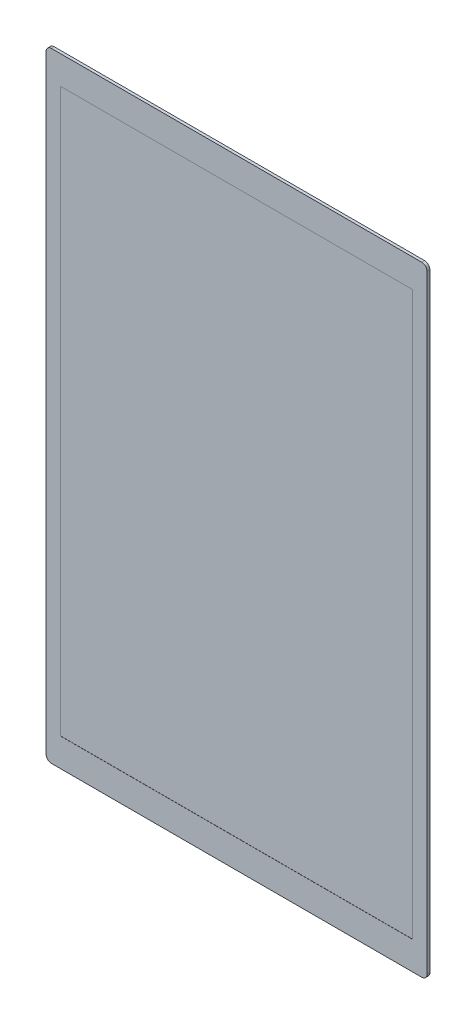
ISO-10303-21;
HEADER;
FILE_DESCRIPTION(('STEP AP214'),'2;1');
FILE_NAME('part.step','',(''),(''),'','','');
FILE_SCHEMA(('AUTOMOTIVE_DESIGN { 1 0 10303 214 1 1 1 1 }'));
ENDSEC;
DATA;
#1=APPLICATION_CONTEXT('core data for automotive mechanical design processes');
#2=APPLICATION_PROTOCOL_DEFINITION('international standard','automotive_design',2000,#1);
#3=PRODUCT_CONTEXT('',#1,'mechanical');
#4=PRODUCT('Part','Part','',(#3));
#5=PRODUCT_RELATED_PRODUCT_CATEGORY('part','',(#4));
#6=PRODUCT_DEFINITION_FORMATION('','',#4);
#7=PRODUCT_DEFINITION_CONTEXT('part definition',#1,'design');
#8=PRODUCT_DEFINITION('design','',#6,#7);
#9=PRODUCT_DEFINITION_SHAPE('','',#8);
#10=(LENGTH_UNIT() NAMED_UNIT(*) SI_UNIT(.MILLI.,.METRE.));
#11=(NAMED_UNIT(*) PLANE_ANGLE_UNIT() SI_UNIT($,.RADIAN.));
#12=(NAMED_UNIT(*) SI_UNIT($,.STERADIAN.) SOLID_ANGLE_UNIT());
#13=UNCERTAINTY_MEASURE_WITH_UNIT(LENGTH_MEASURE(1.E-05),#10,'distance_accuracy_value','');
#14=(GEOMETRIC_REPRESENTATION_CONTEXT(3) GLOBAL_UNCERTAINTY_ASSIGNED_CONTEXT((#13)) GLOBAL_UNIT_ASSIGNED_CONTEXT((#10,
#11,#12)) REPRESENTATION_CONTEXT('',''));
#15=CARTESIAN_POINT('',(0.,0.,0.));
#16=DIRECTION('',(0.,0.,1.));
#17=DIRECTION('',(1.,0.,0.));
#18=AXIS2_PLACEMENT_3D('',#15,#16,#17);
#19=CARTESIAN_POINT('',(-30.,-113.4113647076,-0.999158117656));
#20=CARTESIAN_POINT('',(-30.,-113.4688433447,-0.999729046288));
#21=CARTESIAN_POINT('',(-30.,-113.9175545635,-1.001894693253));
#22=CARTESIAN_POINT('',(-30.,-114.7069118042,-0.9701800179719));
#23=CARTESIAN_POINT('',(-30.,-115.8276897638,-0.9075701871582));
#24=CARTESIAN_POINT('',(-30.,-116.724670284,-0.5670151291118));
#25=CARTESIAN_POINT('',(-30.,-117.4196117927,-0.04288231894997));
#26=CARTESIAN_POINT('',(-30.,-117.7182414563,0.9373655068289));
#27=CARTESIAN_POINT('',(-30.,-117.7584166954,1.837918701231));
#28=CARTESIAN_POINT('',(-30.,-117.6014066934,2.755305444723));
#29=CARTESIAN_POINT('',(-30.,-117.2322542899,3.252516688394));
#30=CARTESIAN_POINT('',(-30.,-116.8869553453,3.535559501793));
#31=CARTESIAN_POINT('',(-30.,-116.6652915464,3.597325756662));
#32=CARTESIAN_POINT('',(-30.,-116.6036777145,3.606806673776));
#33=(BOUNDED_CURVE() B_SPLINE_CURVE(3,(#19,#20,#21,#22,#23,#24,#25,#26,#27,#28,#29,#30,#31,#32),
.UNSPECIFIED.,.F.,.F.) B_SPLINE_CURVE_WITH_KNOTS((4,1,1,1,1,1,1,1,1,1,1,4),(0.,0.01927765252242,
0.1540801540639,0.3226825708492,0.4263227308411,0.5046425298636,0.6129596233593,0.7659463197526,
0.8551329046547,0.9297476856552,0.9818290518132,1.),
.UNSPECIFIED.) CURVE() GEOMETRIC_REPRESENTATION_ITEM() RATIONAL_B_SPLINE_CURVE((1.,1.,1.,1.,1.,
1.,1.,1.,1.,1.,1.,1.,1.,1.)) REPRESENTATION_ITEM(''));
#34=DIRECTION('',(1.,0.,0.));
#35=VECTOR('',#34,1.);
#36=SURFACE_OF_LINEAR_EXTRUSION('',#33,#35);
#37=DIRECTION('',(1.,0.,0.));
#38=VECTOR('',#37,1.);
#39=CARTESIAN_POINT('',(-30.,-113.58,-1.));
#40=LINE('',#39,#38);
#41=CARTESIAN_POINT('',(-30.,-113.58,-1.));
#42=VERTEX_POINT('',#41);
#43=CARTESIAN_POINT('',(-21.75,-113.58,-1.));
#44=VERTEX_POINT('',#43);
#45=EDGE_CURVE('E42',#42,#44,#40,.T.);
#46=ORIENTED_EDGE('',*,*,#45,.F.);
#47=CARTESIAN_POINT('',(-30.,-113.58,-1.));
#48=CARTESIAN_POINT('',(-30.,-113.9647122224,-1.));
#49=CARTESIAN_POINT('',(-30.,-114.7069118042,-0.9701800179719));
#50=CARTESIAN_POINT('',(-30.,-115.8276897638,-0.9075701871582));
#51=CARTESIAN_POINT('',(-30.,-116.724670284,-0.5670151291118));
#52=CARTESIAN_POINT('',(-30.,-117.4196117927,-0.04288231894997));
#53=CARTESIAN_POINT('',(-30.,-117.7182414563,0.9373655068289));
#54=CARTESIAN_POINT('',(-30.,-117.7584166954,1.837918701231));
#55=CARTESIAN_POINT('',(-30.,-117.6014066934,2.755305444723));
#56=CARTESIAN_POINT('',(-30.,-117.2322542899,3.252516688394));
#57=CARTESIAN_POINT('',(-30.,-116.9302668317,3.500056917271));
#58=CARTESIAN_POINT('',(-30.,-116.7763324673,3.560323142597));
#59=(BOUNDED_CURVE() B_SPLINE_CURVE(3,(#47,#48,#49,#50,#51,#52,#53,#54,#55,#56,#57,#58),
.UNSPECIFIED.,.F.,.F.) B_SPLINE_CURVE_WITH_KNOTS((4,1,1,1,1,1,1,1,1,4),(0.,0.1400470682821,
0.3152090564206,0.4228813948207,0.5042482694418,0.6167795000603,0.7757182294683,0.8683746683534,
0.9458923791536,1.),
.UNSPECIFIED.) CURVE() GEOMETRIC_REPRESENTATION_ITEM() RATIONAL_B_SPLINE_CURVE((1.,1.,1.,1.,1.,
1.,1.,1.,1.,1.,1.,1.)) REPRESENTATION_ITEM(''));
#60=CARTESIAN_POINT('',(-30.,-116.7763324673,3.560323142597));
#61=VERTEX_POINT('',#60);
#62=EDGE_CURVE('E11',#42,#61,#59,.T.);
#63=ORIENTED_EDGE('',*,*,#62,.T.);
#64=DIRECTION('',(1.,0.,0.));
#65=VECTOR('',#64,1.);
#66=CARTESIAN_POINT('',(-30.,-116.7763324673,3.560323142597));
#67=LINE('',#66,#65);
#68=CARTESIAN_POINT('',(-21.75,-116.7763324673,3.560323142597));
#69=VERTEX_POINT('',#68);
#70=EDGE_CURVE('E29',#61,#69,#67,.T.);
#71=ORIENTED_EDGE('',*,*,#70,.T.);
#72=CARTESIAN_POINT('',(-21.75,-113.58,-1.));
#73=CARTESIAN_POINT('',(-21.75,-113.9647122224,-1.));
#74=CARTESIAN_POINT('',(-21.75,-114.7069118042,-0.9701800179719));
#75=CARTESIAN_POINT('',(-21.75,-115.8276897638,-0.9075701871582));
#76=CARTESIAN_POINT('',(-21.75,-116.724670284,-0.5670151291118));
#77=CARTESIAN_POINT('',(-21.75,-117.4196117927,-0.04288231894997));
#78=CARTESIAN_POINT('',(-21.75,-117.7182414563,0.9373655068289));
#79=CARTESIAN_POINT('',(-21.75,-117.7584166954,1.837918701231));
#80=CARTESIAN_POINT('',(-21.75,-117.6014066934,2.755305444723));
#81=CARTESIAN_POINT('',(-21.75,-117.2322542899,3.252516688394));
#82=CARTESIAN_POINT('',(-21.75,-116.9302668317,3.500056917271));
#83=CARTESIAN_POINT('',(-21.75,-116.7763324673,3.560323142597));
#84=(BOUNDED_CURVE() B_SPLINE_CURVE(3,(#72,#73,#74,#75,#76,#77,#78,#79,#80,#81,#82,#83),
.UNSPECIFIED.,.F.,.F.) B_SPLINE_CURVE_WITH_KNOTS((4,1,1,1,1,1,1,1,1,4),(0.,0.1400470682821,
0.3152090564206,0.4228813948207,0.5042482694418,0.6167795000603,0.7757182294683,0.8683746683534,
0.9458923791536,1.),
.UNSPECIFIED.) CURVE() GEOMETRIC_REPRESENTATION_ITEM() RATIONAL_B_SPLINE_CURVE((1.,1.,1.,1.,1.,
1.,1.,1.,1.,1.,1.,1.)) REPRESENTATION_ITEM(''));
#85=EDGE_CURVE('E864',#44,#69,#84,.T.);
#86=ORIENTED_EDGE('',*,*,#85,.F.);
#87=EDGE_LOOP('',(#46,#63,#71,#86));
#88=FACE_BOUND('',#87,.T.);
#89=ADVANCED_FACE('F18',(#88),#36,.T.);
#90=CARTESIAN_POINT('',(-30.,-113.4113647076,-0.999158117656));
#91=CARTESIAN_POINT('',(-30.,-113.4688433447,-0.999729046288));
#92=CARTESIAN_POINT('',(-30.,-113.9175545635,-1.001894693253));
#93=CARTESIAN_POINT('',(-30.,-114.7069118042,-0.9701800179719));
#94=CARTESIAN_POINT('',(-30.,-115.8276897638,-0.9075701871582));
#95=CARTESIAN_POINT('',(-30.,-116.724670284,-0.5670151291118));
#96=CARTESIAN_POINT('',(-30.,-117.4196117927,-0.04288231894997));
#97=CARTESIAN_POINT('',(-30.,-117.7182414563,0.9373655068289));
#98=CARTESIAN_POINT('',(-30.,-117.7584166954,1.837918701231));
#99=CARTESIAN_POINT('',(-30.,-117.6014066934,2.755305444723));
#100=CARTESIAN_POINT('',(-30.,-117.2322542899,3.252516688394));
#101=CARTESIAN_POINT('',(-30.,-116.8869553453,3.535559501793));
#102=CARTESIAN_POINT('',(-30.,-116.6652915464,3.597325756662));
#103=CARTESIAN_POINT('',(-30.,-116.6036777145,3.606806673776));
#104=(BOUNDED_CURVE() B_SPLINE_CURVE(3,(#90,#91,#92,#93,#94,#95,#96,#97,#98,#99,#100,#101,#102,
#103),.UNSPECIFIED.,.F.,.F.) B_SPLINE_CURVE_WITH_KNOTS((4,1,1,1,1,1,1,1,1,1,1,4),(0.,
0.01927765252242,0.1540801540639,0.3226825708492,0.4263227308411,0.5046425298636,
0.6129596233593,0.7659463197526,0.8551329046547,0.9297476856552,0.9818290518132,1.),
.UNSPECIFIED.) CURVE() GEOMETRIC_REPRESENTATION_ITEM() RATIONAL_B_SPLINE_CURVE((1.,1.,1.,1.,1.,
1.,1.,1.,1.,1.,1.,1.,1.,1.)) REPRESENTATION_ITEM(''));
#105=DIRECTION('',(1.,0.,0.));
#106=VECTOR('',#105,1.);
#107=SURFACE_OF_LINEAR_EXTRUSION('',#104,#106);
#108=DIRECTION('',(1.,0.,0.));
#109=VECTOR('',#108,1.);
#110=CARTESIAN_POINT('',(-18.25,-116.7763324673,3.560323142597));
#111=LINE('',#110,#109);
#112=CARTESIAN_POINT('',(-18.25,-116.7763324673,3.560323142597));
#113=VERTEX_POINT('',#112);
#114=CARTESIAN_POINT('',(-10.,-116.7763324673,3.560323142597));
#115=VERTEX_POINT('',#114);
#116=EDGE_CURVE('E845',#113,#115,#111,.T.);
#117=ORIENTED_EDGE('',*,*,#116,.T.);
#118=CARTESIAN_POINT('',(-10.,-113.58,-1.));
#119=CARTESIAN_POINT('',(-10.,-113.9647122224,-1.));
#120=CARTESIAN_POINT('',(-10.,-114.7069118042,-0.9701800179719));
#121=CARTESIAN_POINT('',(-10.,-115.8276897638,-0.9075701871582));
#122=CARTESIAN_POINT('',(-10.,-116.724670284,-0.5670151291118));
#123=CARTESIAN_POINT('',(-10.,-117.4196117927,-0.04288231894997));
#124=CARTESIAN_POINT('',(-10.,-117.7182414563,0.9373655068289));
#125=CARTESIAN_POINT('',(-10.,-117.7584166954,1.837918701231));
#126=CARTESIAN_POINT('',(-10.,-117.6014066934,2.755305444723));
#127=CARTESIAN_POINT('',(-10.,-117.2322542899,3.252516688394));
#128=CARTESIAN_POINT('',(-10.,-116.9302668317,3.500056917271));
#129=CARTESIAN_POINT('',(-10.,-116.7763324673,3.560323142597));
#130=(BOUNDED_CURVE() B_SPLINE_CURVE(3,(#118,#119,#120,#121,#122,#123,#124,#125,#126,#127,#128,
#129),.UNSPECIFIED.,.F.,.F.) B_SPLINE_CURVE_WITH_KNOTS((4,1,1,1,1,1,1,1,1,4),(0.,
0.1400470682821,0.3152090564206,0.4228813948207,0.5042482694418,0.6167795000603,0.7757182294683,
0.8683746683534,0.9458923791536,1.),
.UNSPECIFIED.) CURVE() GEOMETRIC_REPRESENTATION_ITEM() RATIONAL_B_SPLINE_CURVE((1.,1.,1.,1.,1.,
1.,1.,1.,1.,1.,1.,1.)) REPRESENTATION_ITEM(''));
#131=CARTESIAN_POINT('',(-10.,-113.58,-1.));
#132=VERTEX_POINT('',#131);
#133=EDGE_CURVE('E858',#132,#115,#130,.T.);
#134=ORIENTED_EDGE('',*,*,#133,.F.);
#135=DIRECTION('',(1.,0.,0.));
#136=VECTOR('',#135,1.);
#137=CARTESIAN_POINT('',(-18.25,-113.58,-1.));
#138=LINE('',#137,#136);
#139=CARTESIAN_POINT('',(-18.25,-113.58,-1.));
#140=VERTEX_POINT('',#139);
#141=EDGE_CURVE('E834',#140,#132,#138,.T.);
#142=ORIENTED_EDGE('',*,*,#141,.F.);
#143=CARTESIAN_POINT('',(-18.25,-113.58,-1.));
#144=CARTESIAN_POINT('',(-18.25,-113.9647122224,-1.));
#145=CARTESIAN_POINT('',(-18.25,-114.7069118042,-0.9701800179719));
#146=CARTESIAN_POINT('',(-18.25,-115.8276897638,-0.9075701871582));
#147=CARTESIAN_POINT('',(-18.25,-116.724670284,-0.5670151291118));
#148=CARTESIAN_POINT('',(-18.25,-117.4196117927,-0.04288231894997));
#149=CARTESIAN_POINT('',(-18.25,-117.7182414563,0.9373655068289));
#150=CARTESIAN_POINT('',(-18.25,-117.7584166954,1.837918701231));
#151=CARTESIAN_POINT('',(-18.25,-117.6014066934,2.755305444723));
#152=CARTESIAN_POINT('',(-18.25,-117.2322542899,3.252516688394));
#153=CARTESIAN_POINT('',(-18.25,-116.9302668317,3.500056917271));
#154=CARTESIAN_POINT('',(-18.25,-116.7763324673,3.560323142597));
#155=(BOUNDED_CURVE() B_SPLINE_CURVE(3,(#143,#144,#145,#146,#147,#148,#149,#150,#151,#152,#153,
#154),.UNSPECIFIED.,.F.,.F.) B_SPLINE_CURVE_WITH_KNOTS((4,1,1,1,1,1,1,1,1,4),(0.,
0.1400470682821,0.3152090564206,0.4228813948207,0.5042482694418,0.6167795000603,0.7757182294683,
0.8683746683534,0.9458923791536,1.),
.UNSPECIFIED.) CURVE() GEOMETRIC_REPRESENTATION_ITEM() RATIONAL_B_SPLINE_CURVE((1.,1.,1.,1.,1.,
1.,1.,1.,1.,1.,1.,1.)) REPRESENTATION_ITEM(''));
#156=EDGE_CURVE('E880',#140,#113,#155,.T.);
#157=ORIENTED_EDGE('',*,*,#156,.T.);
#158=EDGE_LOOP('',(#117,#134,#142,#157));
#159=FACE_BOUND('',#158,.T.);
#160=ADVANCED_FACE('F1499',(#159),#107,.T.);
#161=CARTESIAN_POINT('',(-18.25,-116.6130045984,3.605316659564));
#162=CARTESIAN_POINT('',(-18.25,-116.6710886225,3.59569486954));
#163=CARTESIAN_POINT('',(-18.25,-116.8891484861,3.533761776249));
#164=CARTESIAN_POINT('',(-18.25,-117.2322542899,3.252516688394));
#165=CARTESIAN_POINT('',(-18.25,-117.6014066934,2.755305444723));
#166=CARTESIAN_POINT('',(-18.25,-117.7584166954,1.837918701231));
#167=CARTESIAN_POINT('',(-18.25,-117.7182414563,0.9373655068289));
#168=CARTESIAN_POINT('',(-18.25,-117.4196117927,-0.04288231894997));
#169=CARTESIAN_POINT('',(-18.25,-116.724670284,-0.5670151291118));
#170=CARTESIAN_POINT('',(-18.25,-115.8276897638,-0.9075701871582));
#171=CARTESIAN_POINT('',(-18.25,-114.7069118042,-0.9701800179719));
#172=CARTESIAN_POINT('',(-18.25,-113.9155440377,-1.001975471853));
#173=CARTESIAN_POINT('',(-18.25,-113.4640543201,-0.999705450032));
#174=CARTESIAN_POINT('',(-18.25,-113.4040057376,-0.9990834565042));
#175=(BOUNDED_CURVE() B_SPLINE_CURVE(3,(#161,#162,#163,#164,#165,#166,#167,#168,#169,#170,#171,
#172,#173,#174),.UNSPECIFIED.,.F.,.F.) B_SPLINE_CURVE_WITH_KNOTS((4,1,1,1,1,1,1,1,1,1,1,4),(0.,
0.01725253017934,0.06933901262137,0.1439611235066,0.2331564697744,0.3861581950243,
0.4944859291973,0.572813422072,0.6764637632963,0.8450827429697,0.9798984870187,1.),
.UNSPECIFIED.) CURVE() GEOMETRIC_REPRESENTATION_ITEM() RATIONAL_B_SPLINE_CURVE((1.,1.,1.,1.,1.,
1.,1.,1.,1.,1.,1.,1.,1.,1.)) REPRESENTATION_ITEM(''));
#176=DIRECTION('',(1.,0.,0.));
#177=VECTOR('',#176,1.);
#178=SURFACE_OF_LINEAR_EXTRUSION('',#175,#177);
#179=DIRECTION('',(-1.,0.,0.));
#180=VECTOR('',#179,1.);
#181=CARTESIAN_POINT('',(-18.25,-116.7763324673,3.560323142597));
#182=LINE('',#181,#180);
#183=EDGE_CURVE('E926',#113,#69,#182,.T.);
#184=ORIENTED_EDGE('',*,*,#183,.F.);
#185=ORIENTED_EDGE('',*,*,#156,.F.);
#186=DIRECTION('',(-1.,0.,0.));
#187=VECTOR('',#186,1.);
#188=CARTESIAN_POINT('',(-18.25,-113.58,-1.));
#189=LINE('',#188,#187);
#190=EDGE_CURVE('E869',#140,#44,#189,.T.);
#191=ORIENTED_EDGE('',*,*,#190,.T.);
#192=ORIENTED_EDGE('',*,*,#85,.T.);
#193=EDGE_LOOP('',(#184,#185,#191,#192));
#194=FACE_BOUND('',#193,.T.);
#195=ADVANCED_FACE('F1555',(#194),#178,.F.);
#196=CARTESIAN_POINT('',(-30.,-99.58,-1.));
#197=DIRECTION('',(0.,0.,1.));
#198=DIRECTION('',(1.,0.,0.));
#199=AXIS2_PLACEMENT_3D('',#196,#197,#198);
#200=PLANE('',#199);
#201=DIRECTION('',(0.,-1.,0.));
#202=VECTOR('',#201,1.);
#203=CARTESIAN_POINT('',(-30.,-99.58,-1.));
#204=LINE('',#203,#202);
#205=CARTESIAN_POINT('',(-30.,-99.58,-1.));
#206=VERTEX_POINT('',#205);
#207=EDGE_CURVE('E870',#206,#42,#204,.T.);
#208=ORIENTED_EDGE('',*,*,#207,.T.);
#209=ORIENTED_EDGE('',*,*,#45,.T.);
#210=ORIENTED_EDGE('',*,*,#190,.F.);
#211=ORIENTED_EDGE('',*,*,#141,.T.);
#212=DIRECTION('',(0.,-1.,0.));
#213=VECTOR('',#212,1.);
#214=CARTESIAN_POINT('',(-10.,-99.58,-1.));
#215=LINE('',#214,#213);
#216=CARTESIAN_POINT('',(-10.,-99.58,-1.));
#217=VERTEX_POINT('',#216);
#218=EDGE_CURVE('E853',#217,#132,#215,.T.);
#219=ORIENTED_EDGE('',*,*,#218,.F.);
#220=DIRECTION('',(1.,0.,0.));
#221=VECTOR('',#220,1.);
#222=CARTESIAN_POINT('',(-18.25,-99.58,-1.));
#223=LINE('',#222,#221);
#224=CARTESIAN_POINT('',(-18.25,-99.58,-1.));
#225=VERTEX_POINT('',#224);
#226=EDGE_CURVE('E955',#225,#217,#223,.T.);
#227=ORIENTED_EDGE('',*,*,#226,.F.);
#228=DIRECTION('',(-1.,0.,0.));
#229=VECTOR('',#228,1.);
#230=CARTESIAN_POINT('',(-18.25,-99.58,-1.));
#231=LINE('',#230,#229);
#232=CARTESIAN_POINT('',(-21.75,-99.58,-1.));
#233=VERTEX_POINT('',#232);
#234=EDGE_CURVE('E831',#225,#233,#231,.T.);
#235=ORIENTED_EDGE('',*,*,#234,.T.);
#236=DIRECTION('',(1.,0.,0.));
#237=VECTOR('',#236,1.);
#238=CARTESIAN_POINT('',(-30.,-99.58,-1.));
#239=LINE('',#238,#237);
#240=EDGE_CURVE('E959',#206,#233,#239,.T.);
#241=ORIENTED_EDGE('',*,*,#240,.F.);
#242=EDGE_LOOP('',(#208,#209,#210,#211,#219,#227,#235,#241));
#243=FACE_BOUND('',#242,.T.);
#244=ADVANCED_FACE('F1545',(#243),#200,.T.);
#245=CARTESIAN_POINT('',(-30.,-97.40237056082,-0.370240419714));
#246=CARTESIAN_POINT('',(-30.,-97.45663461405,-0.362920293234));
#247=CARTESIAN_POINT('',(-30.,-97.64337663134,-0.3539448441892));
#248=CARTESIAN_POINT('',(-30.,-98.00353362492,-0.3845580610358));
#249=CARTESIAN_POINT('',(-30.,-98.33678628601,-0.4153218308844));
#250=CARTESIAN_POINT('',(-30.,-98.55986571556,-0.6087775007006));
#251=CARTESIAN_POINT('',(-30.,-98.84842655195,-0.896230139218));
#252=CARTESIAN_POINT('',(-30.,-99.24850239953,-0.9728576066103));
#253=CARTESIAN_POINT('',(-30.,-99.52121956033,-1.007270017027));
#254=CARTESIAN_POINT('',(-30.,-99.71332314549,-0.9959592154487));
#255=CARTESIAN_POINT('',(-30.,-99.78993326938,-0.9865483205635));
#256=(BOUNDED_CURVE() B_SPLINE_CURVE(3,(#245,#246,#247,#248,#249,#250,#251,#252,#253,#254,#255),
.UNSPECIFIED.,.F.,.F.) B_SPLINE_CURVE_WITH_KNOTS((4,1,1,1,1,1,1,1,4),(0.,0.08165379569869,
0.2509609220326,0.412819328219,0.5419802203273,0.6767519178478,0.8088457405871,0.931710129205,
1.),.UNSPECIFIED.) CURVE() GEOMETRIC_REPRESENTATION_ITEM() RATIONAL_B_SPLINE_CURVE((1.,1.,1.,1.,
1.,1.,1.,1.,1.,1.,1.)) REPRESENTATION_ITEM(''));
#257=DIRECTION('',(1.,0.,0.));
#258=VECTOR('',#257,1.);
#259=SURFACE_OF_LINEAR_EXTRUSION('',#256,#258);
#260=DIRECTION('',(1.,0.,0.));
#261=VECTOR('',#260,1.);
#262=CARTESIAN_POINT('',(-30.,-97.58156232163,-0.36));
#263=LINE('',#262,#261);
#264=CARTESIAN_POINT('',(-30.,-97.58156232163,-0.36));
#265=VERTEX_POINT('',#264);
#266=CARTESIAN_POINT('',(-21.75,-97.58156232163,-0.36));
#267=VERTEX_POINT('',#266);
#268=EDGE_CURVE('E902',#265,#267,#263,.T.);
#269=ORIENTED_EDGE('',*,*,#268,.F.);
#270=CARTESIAN_POINT('',(-30.,-97.58156232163,-0.36));
#271=CARTESIAN_POINT('',(-30.,-97.71461405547,-0.36));
#272=CARTESIAN_POINT('',(-30.,-98.00353362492,-0.3845580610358));
#273=CARTESIAN_POINT('',(-30.,-98.33678628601,-0.4153218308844));
#274=CARTESIAN_POINT('',(-30.,-98.55986571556,-0.6087775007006));
#275=CARTESIAN_POINT('',(-30.,-98.84842655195,-0.896230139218));
#276=CARTESIAN_POINT('',(-30.,-99.24850239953,-0.9728576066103));
#277=CARTESIAN_POINT('',(-30.,-99.46360492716,-1.));
#278=CARTESIAN_POINT('',(-30.,-99.58,-1.));
#279=(BOUNDED_CURVE() B_SPLINE_CURVE(3,(#270,#271,#272,#273,#274,#275,#276,#277,#278),
.UNSPECIFIED.,.F.,.F.) B_SPLINE_CURVE_WITH_KNOTS((4,1,1,1,1,1,4),(0.,0.1991716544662,
0.3895806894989,0.5415246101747,0.7000690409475,0.8554632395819,1.),
.UNSPECIFIED.) CURVE() GEOMETRIC_REPRESENTATION_ITEM() RATIONAL_B_SPLINE_CURVE((1.,1.,1.,1.,1.,
1.,1.,1.,1.)) REPRESENTATION_ITEM(''));
#280=EDGE_CURVE('E835',#265,#206,#279,.T.);
#281=ORIENTED_EDGE('',*,*,#280,.T.);
#282=ORIENTED_EDGE('',*,*,#240,.T.);
#283=CARTESIAN_POINT('',(-21.75,-97.58156232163,-0.36));
#284=CARTESIAN_POINT('',(-21.75,-97.71461405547,-0.36));
#285=CARTESIAN_POINT('',(-21.75,-98.00353362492,-0.3845580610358));
#286=CARTESIAN_POINT('',(-21.75,-98.33678628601,-0.4153218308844));
#287=CARTESIAN_POINT('',(-21.75,-98.55986571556,-0.6087775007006));
#288=CARTESIAN_POINT('',(-21.75,-98.84842655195,-0.896230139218));
#289=CARTESIAN_POINT('',(-21.75,-99.24850239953,-0.9728576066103));
#290=CARTESIAN_POINT('',(-21.75,-99.46360492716,-1.));
#291=CARTESIAN_POINT('',(-21.75,-99.58,-1.));
#292=(BOUNDED_CURVE() B_SPLINE_CURVE(3,(#283,#284,#285,#286,#287,#288,#289,#290,#291),
.UNSPECIFIED.,.F.,.F.) B_SPLINE_CURVE_WITH_KNOTS((4,1,1,1,1,1,4),(0.,0.1991716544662,
0.3895806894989,0.5415246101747,0.7000690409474,0.8554632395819,1.),
.UNSPECIFIED.) CURVE() GEOMETRIC_REPRESENTATION_ITEM() RATIONAL_B_SPLINE_CURVE((1.,1.,1.,1.,1.,
1.,1.,1.,1.)) REPRESENTATION_ITEM(''));
#293=EDGE_CURVE('E979',#267,#233,#292,.T.);
#294=ORIENTED_EDGE('',*,*,#293,.F.);
#295=EDGE_LOOP('',(#269,#281,#282,#294));
#296=FACE_BOUND('',#295,.T.);
#297=ADVANCED_FACE('F1539',(#296),#259,.T.);
#298=CARTESIAN_POINT('',(-30.,-97.40237056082,-0.370240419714));
#299=CARTESIAN_POINT('',(-30.,-97.45663461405,-0.362920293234));
#300=CARTESIAN_POINT('',(-30.,-97.64337663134,-0.3539448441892));
#301=CARTESIAN_POINT('',(-30.,-98.00353362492,-0.3845580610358));
#302=CARTESIAN_POINT('',(-30.,-98.33678628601,-0.4153218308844));
#303=CARTESIAN_POINT('',(-30.,-98.55986571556,-0.6087775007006));
#304=CARTESIAN_POINT('',(-30.,-98.84842655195,-0.896230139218));
#305=CARTESIAN_POINT('',(-30.,-99.24850239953,-0.9728576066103));
#306=CARTESIAN_POINT('',(-30.,-99.52121956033,-1.007270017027));
#307=CARTESIAN_POINT('',(-30.,-99.71332314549,-0.9959592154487));
#308=CARTESIAN_POINT('',(-30.,-99.78993326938,-0.9865483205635));
#309=(BOUNDED_CURVE() B_SPLINE_CURVE(3,(#298,#299,#300,#301,#302,#303,#304,#305,#306,#307,#308),
.UNSPECIFIED.,.F.,.F.) B_SPLINE_CURVE_WITH_KNOTS((4,1,1,1,1,1,1,1,4),(0.,0.08165379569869,
0.2509609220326,0.412819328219,0.5419802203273,0.6767519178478,0.8088457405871,0.931710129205,
1.),.UNSPECIFIED.) CURVE() GEOMETRIC_REPRESENTATION_ITEM() RATIONAL_B_SPLINE_CURVE((1.,1.,1.,1.,
1.,1.,1.,1.,1.,1.,1.)) REPRESENTATION_ITEM(''));
#310=DIRECTION('',(1.,0.,0.));
#311=VECTOR('',#310,1.);
#312=SURFACE_OF_LINEAR_EXTRUSION('',#309,#311);
#313=ORIENTED_EDGE('',*,*,#226,.T.);
#314=CARTESIAN_POINT('',(-10.,-97.58156232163,-0.36));
#315=CARTESIAN_POINT('',(-10.,-97.71461405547,-0.36));
#316=CARTESIAN_POINT('',(-10.,-98.00353362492,-0.3845580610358));
#317=CARTESIAN_POINT('',(-10.,-98.33678628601,-0.4153218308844));
#318=CARTESIAN_POINT('',(-10.,-98.55986571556,-0.6087775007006));
#319=CARTESIAN_POINT('',(-10.,-98.84842655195,-0.896230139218));
#320=CARTESIAN_POINT('',(-10.,-99.24850239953,-0.9728576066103));
#321=CARTESIAN_POINT('',(-10.,-99.46360492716,-1.));
#322=CARTESIAN_POINT('',(-10.,-99.58,-1.));
#323=(BOUNDED_CURVE() B_SPLINE_CURVE(3,(#314,#315,#316,#317,#318,#319,#320,#321,#322),
.UNSPECIFIED.,.F.,.F.) B_SPLINE_CURVE_WITH_KNOTS((4,1,1,1,1,1,4),(0.,0.1991716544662,
0.3895806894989,0.5415246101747,0.7000690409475,0.8554632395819,1.),
.UNSPECIFIED.) CURVE() GEOMETRIC_REPRESENTATION_ITEM() RATIONAL_B_SPLINE_CURVE((1.,1.,1.,1.,1.,
1.,1.,1.,1.)) REPRESENTATION_ITEM(''));
#324=CARTESIAN_POINT('',(-10.,-97.58156232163,-0.36));
#325=VERTEX_POINT('',#324);
#326=EDGE_CURVE('E857',#325,#217,#323,.T.);
#327=ORIENTED_EDGE('',*,*,#326,.F.);
#328=DIRECTION('',(1.,0.,0.));
#329=VECTOR('',#328,1.);
#330=CARTESIAN_POINT('',(-18.25,-97.58156232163,-0.36));
#331=LINE('',#330,#329);
#332=CARTESIAN_POINT('',(-18.25,-97.58156232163,-0.36));
#333=VERTEX_POINT('',#332);
#334=EDGE_CURVE('E840',#333,#325,#331,.T.);
#335=ORIENTED_EDGE('',*,*,#334,.F.);
#336=CARTESIAN_POINT('',(-18.25,-97.58156232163,-0.36));
#337=CARTESIAN_POINT('',(-18.25,-97.71461405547,-0.36));
#338=CARTESIAN_POINT('',(-18.25,-98.00353362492,-0.3845580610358));
#339=CARTESIAN_POINT('',(-18.25,-98.33678628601,-0.4153218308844));
#340=CARTESIAN_POINT('',(-18.25,-98.55986571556,-0.6087775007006));
#341=CARTESIAN_POINT('',(-18.25,-98.84842655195,-0.896230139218));
#342=CARTESIAN_POINT('',(-18.25,-99.24850239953,-0.9728576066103));
#343=CARTESIAN_POINT('',(-18.25,-99.46360492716,-1.));
#344=CARTESIAN_POINT('',(-18.25,-99.58,-1.));
#345=(BOUNDED_CURVE() B_SPLINE_CURVE(3,(#336,#337,#338,#339,#340,#341,#342,#343,#344),
.UNSPECIFIED.,.F.,.F.) B_SPLINE_CURVE_WITH_KNOTS((4,1,1,1,1,1,4),(0.,0.1991716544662,
0.3895806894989,0.5415246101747,0.7000690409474,0.8554632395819,1.),
.UNSPECIFIED.) CURVE() GEOMETRIC_REPRESENTATION_ITEM() RATIONAL_B_SPLINE_CURVE((1.,1.,1.,1.,1.,
1.,1.,1.,1.)) REPRESENTATION_ITEM(''));
#346=EDGE_CURVE('E960',#333,#225,#345,.T.);
#347=ORIENTED_EDGE('',*,*,#346,.T.);
#348=EDGE_LOOP('',(#313,#327,#335,#347));
#349=FACE_BOUND('',#348,.T.);
#350=ADVANCED_FACE('F1544',(#349),#312,.T.);
#351=CARTESIAN_POINT('',(-18.25,-99.76513884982,-0.9894384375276));
#352=CARTESIAN_POINT('',(-18.25,-99.6983953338,-0.9967928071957));
#353=CARTESIAN_POINT('',(-18.25,-99.51493388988,-1.006476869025));
#354=CARTESIAN_POINT('',(-18.25,-99.24850239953,-0.9728576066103));
#355=CARTESIAN_POINT('',(-18.25,-98.84842655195,-0.896230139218));
#356=CARTESIAN_POINT('',(-18.25,-98.55986571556,-0.6087775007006));
#357=CARTESIAN_POINT('',(-18.25,-98.33678628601,-0.4153218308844));
#358=CARTESIAN_POINT('',(-18.25,-98.00353362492,-0.3845580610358));
#359=CARTESIAN_POINT('',(-18.25,-97.6502510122,-0.3545291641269));
#360=CARTESIAN_POINT('',(-18.25,-97.46839284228,-0.3623838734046));
#361=CARTESIAN_POINT('',(-18.25,-97.41825861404,-0.3682428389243));
#362=(BOUNDED_CURVE() B_SPLINE_CURVE(3,(#351,#352,#353,#354,#355,#356,#357,#358,#359,#360,#361),
.UNSPECIFIED.,.F.,.F.) B_SPLINE_CURVE_WITH_KNOTS((4,1,1,1,1,1,1,1,4),(0.,0.06178673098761,
0.1865639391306,0.3207142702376,0.4575841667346,0.5887559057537,0.7531342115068,0.9250772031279,
1.),.UNSPECIFIED.) CURVE() GEOMETRIC_REPRESENTATION_ITEM() RATIONAL_B_SPLINE_CURVE((1.,1.,1.,1.,
1.,1.,1.,1.,1.,1.,1.)) REPRESENTATION_ITEM(''));
#363=DIRECTION('',(1.,0.,0.));
#364=VECTOR('',#363,1.);
#365=SURFACE_OF_LINEAR_EXTRUSION('',#362,#364);
#366=ORIENTED_EDGE('',*,*,#234,.F.);
#367=ORIENTED_EDGE('',*,*,#346,.F.);
#368=DIRECTION('',(-1.,0.,0.));
#369=VECTOR('',#368,1.);
#370=CARTESIAN_POINT('',(-18.25,-97.58156232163,-0.36));
#371=LINE('',#370,#369);
#372=EDGE_CURVE('E985',#333,#267,#371,.T.);
#373=ORIENTED_EDGE('',*,*,#372,.T.);
#374=ORIENTED_EDGE('',*,*,#293,.T.);
#375=EDGE_LOOP('',(#366,#367,#373,#374));
#376=FACE_BOUND('',#375,.T.);
#377=ADVANCED_FACE('F1487',(#376),#365,.F.);
#378=CARTESIAN_POINT('',(-30.,-91.58,-0.36));
#379=DIRECTION('',(0.,0.,1.));
#380=DIRECTION('',(1.,0.,0.));
#381=AXIS2_PLACEMENT_3D('',#378,#379,#380);
#382=PLANE('',#381);
#383=CARTESIAN_POINT('',(-29.5,-92.08,-0.36));
#384=DIRECTION('',(0.,0.,1.));
#385=DIRECTION('',(0.,1.,0.));
#386=AXIS2_PLACEMENT_3D('',#383,#384,#385);
#387=CIRCLE('',#386,0.5);
#388=CARTESIAN_POINT('',(-29.5,-91.58,-0.36));
#389=VERTEX_POINT('',#388);
#390=CARTESIAN_POINT('',(-30.,-92.08,-0.36));
#391=VERTEX_POINT('',#390);
#392=EDGE_CURVE('E901',#389,#391,#387,.T.);
#393=ORIENTED_EDGE('',*,*,#392,.T.);
#394=DIRECTION('',(0.,-1.,0.));
#395=VECTOR('',#394,1.);
#396=CARTESIAN_POINT('',(-30.,-92.08,-0.36));
#397=LINE('',#396,#395);
#398=EDGE_CURVE('E894',#391,#265,#397,.T.);
#399=ORIENTED_EDGE('',*,*,#398,.T.);
#400=ORIENTED_EDGE('',*,*,#268,.T.);
#401=ORIENTED_EDGE('',*,*,#372,.F.);
#402=ORIENTED_EDGE('',*,*,#334,.T.);
#403=DIRECTION('',(0.,-1.,0.));
#404=VECTOR('',#403,1.);
#405=CARTESIAN_POINT('',(-10.,-92.08,-0.36));
#406=LINE('',#405,#404);
#407=CARTESIAN_POINT('',(-10.,-92.08,-0.36));
#408=VERTEX_POINT('',#407);
#409=EDGE_CURVE('E934',#408,#325,#406,.T.);
#410=ORIENTED_EDGE('',*,*,#409,.F.);
#411=CARTESIAN_POINT('',(-10.5,-92.08,-0.36));
#412=DIRECTION('',(0.,0.,1.));
#413=DIRECTION('',(1.,0.,0.));
#414=AXIS2_PLACEMENT_3D('',#411,#412,#413);
#415=CIRCLE('',#414,0.5);
#416=CARTESIAN_POINT('',(-10.5,-91.58,-0.36));
#417=VERTEX_POINT('',#416);
#418=EDGE_CURVE('E836',#408,#417,#415,.T.);
#419=ORIENTED_EDGE('',*,*,#418,.T.);
#420=DIRECTION('',(-1.,0.,0.));
#421=VECTOR('',#420,1.);
#422=CARTESIAN_POINT('',(-10.5,-91.58,-0.36));
#423=LINE('',#422,#421);
#424=EDGE_CURVE('E841',#417,#389,#423,.T.);
#425=ORIENTED_EDGE('',*,*,#424,.T.);
#426=EDGE_LOOP('',(#393,#399,#400,#401,#402,#410,#419,#425));
#427=FACE_BOUND('',#426,.T.);
#428=ADVANCED_FACE('F1481',(#427),#382,.T.);
#429=CARTESIAN_POINT('',(-30.,-91.58,-0.51));
#430=DIRECTION('',(0.,1.,0.));
#431=DIRECTION('',(1.,0.,0.));
#432=AXIS2_PLACEMENT_3D('',#429,#430,#431);
#433=PLANE('',#432);
#434=DIRECTION('',(0.,0.,1.));
#435=VECTOR('',#434,1.);
#436=CARTESIAN_POINT('',(-10.5,-91.58,-0.51));
#437=LINE('',#436,#435);
#438=CARTESIAN_POINT('',(-10.5,-91.58,-0.51));
#439=VERTEX_POINT('',#438);
#440=EDGE_CURVE('E610',#439,#417,#437,.T.);
#441=ORIENTED_EDGE('',*,*,#440,.F.);
#442=DIRECTION('',(1.,0.,0.));
#443=VECTOR('',#442,1.);
#444=CARTESIAN_POINT('',(-29.5,-91.58,-0.51));
#445=LINE('',#444,#443);
#446=CARTESIAN_POINT('',(-29.5,-91.58,-0.51));
#447=VERTEX_POINT('',#446);
#448=EDGE_CURVE('E1025',#447,#439,#445,.T.);
#449=ORIENTED_EDGE('',*,*,#448,.F.);
#450=DIRECTION('',(0.,0.,-1.));
#451=VECTOR('',#450,1.);
#452=CARTESIAN_POINT('',(-29.5,-91.58,-0.36));
#453=LINE('',#452,#451);
#454=EDGE_CURVE('E1014',#389,#447,#453,.T.);
#455=ORIENTED_EDGE('',*,*,#454,.F.);
#456=ORIENTED_EDGE('',*,*,#424,.F.);
#457=EDGE_LOOP('',(#441,#449,#455,#456));
#458=FACE_BOUND('',#457,.T.);
#459=ADVANCED_FACE('F1486',(#458),#433,.T.);
#460=CARTESIAN_POINT('',(-29.5,-92.08,15.04681199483));
#461=DIRECTION('',(0.,0.,-1.));
#462=DIRECTION('',(-1.,0.,0.));
#463=AXIS2_PLACEMENT_3D('',#460,#461,#462);
#464=CYLINDRICAL_SURFACE('',#463,0.5);
#465=CARTESIAN_POINT('',(-29.5,-92.08,-0.51));
#466=DIRECTION('',(0.,0.,-1.));
#467=DIRECTION('',(-1.,0.,0.));
#468=AXIS2_PLACEMENT_3D('',#465,#466,#467);
#469=CIRCLE('',#468,0.5);
#470=CARTESIAN_POINT('',(-30.,-92.08,-0.51));
#471=VERTEX_POINT('',#470);
#472=EDGE_CURVE('E1031',#471,#447,#469,.T.);
#473=ORIENTED_EDGE('',*,*,#472,.F.);
#474=DIRECTION('',(0.,0.,-1.));
#475=VECTOR('',#474,1.);
#476=CARTESIAN_POINT('',(-30.,-92.08,-0.36));
#477=LINE('',#476,#475);
#478=EDGE_CURVE('E1035',#391,#471,#477,.T.);
#479=ORIENTED_EDGE('',*,*,#478,.F.);
#480=ORIENTED_EDGE('',*,*,#392,.F.);
#481=ORIENTED_EDGE('',*,*,#454,.T.);
#482=EDGE_LOOP('',(#473,#479,#480,#481));
#483=FACE_BOUND('',#482,.T.);
#484=ADVANCED_FACE('F1585',(#483),#464,.T.);
#485=CARTESIAN_POINT('',(-30.,0.,0.));
#486=DIRECTION('',(1.,0.,0.));
#487=DIRECTION('',(0.,1.,0.));
#488=AXIS2_PLACEMENT_3D('',#485,#486,#487);
#489=PLANE('',#488);
#490=DIRECTION('',(0.,1.,0.));
#491=VECTOR('',#490,1.);
#492=CARTESIAN_POINT('',(-30.,-97.58156232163,-0.51));
#493=LINE('',#492,#491);
#494=CARTESIAN_POINT('',(-30.,-97.58156232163,-0.51));
#495=VERTEX_POINT('',#494);
#496=EDGE_CURVE('E621',#495,#471,#493,.T.);
#497=ORIENTED_EDGE('',*,*,#496,.F.);
#498=CARTESIAN_POINT('',(-30.,-99.58,-1.15));
#499=CARTESIAN_POINT('',(-30.,-99.45314772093,-1.15));
#500=CARTESIAN_POINT('',(-30.,-99.23012407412,-1.122473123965));
#501=CARTESIAN_POINT('',(-30.,-98.77880324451,-1.0349372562));
#502=CARTESIAN_POINT('',(-30.,-98.43578100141,-0.7004149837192));
#503=CARTESIAN_POINT('',(-30.,-98.28600281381,-0.5649847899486));
#504=CARTESIAN_POINT('',(-30.,-98.00016338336,-0.5335563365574));
#505=CARTESIAN_POINT('',(-30.,-97.70484540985,-0.51));
#506=CARTESIAN_POINT('',(-30.,-97.58156232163,-0.51));
#507=(BOUNDED_CURVE() B_SPLINE_CURVE(3,(#498,#499,#500,#501,#502,#503,#504,#505,#506),
.UNSPECIFIED.,.F.,.F.) B_SPLINE_CURVE_WITH_KNOTS((4,1,1,1,1,1,4),(0.,0.1445367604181,
0.2999309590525,0.4584753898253,0.6104193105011,0.8008283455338,1.),
.UNSPECIFIED.) CURVE() GEOMETRIC_REPRESENTATION_ITEM() RATIONAL_B_SPLINE_CURVE((1.,1.,1.,1.,1.,
1.,1.,1.,1.)) REPRESENTATION_ITEM(''));
#508=CARTESIAN_POINT('',(-30.,-99.58,-1.15));
#509=VERTEX_POINT('',#508);
#510=EDGE_CURVE('E643',#509,#495,#507,.T.);
#511=ORIENTED_EDGE('',*,*,#510,.F.);
#512=DIRECTION('',(0.,1.,0.));
#513=VECTOR('',#512,1.);
#514=CARTESIAN_POINT('',(-30.,-113.58,-1.15));
#515=LINE('',#514,#513);
#516=CARTESIAN_POINT('',(-30.,-113.58,-1.15));
#517=VERTEX_POINT('',#516);
#518=EDGE_CURVE('E658',#517,#509,#515,.T.);
#519=ORIENTED_EDGE('',*,*,#518,.F.);
#520=CARTESIAN_POINT('',(-30.,-116.8310167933,3.7));
#521=CARTESIAN_POINT('',(-30.,-117.011633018,3.629287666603));
#522=CARTESIAN_POINT('',(-30.,-117.3472981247,3.352676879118));
#523=CARTESIAN_POINT('',(-30.,-117.7431590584,2.813892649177));
#524=CARTESIAN_POINT('',(-30.,-117.910834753,1.834915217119));
#525=CARTESIAN_POINT('',(-30.,-117.8715058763,0.9264588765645));
#526=CARTESIAN_POINT('',(-30.,-117.5490127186,-0.1319938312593));
#527=CARTESIAN_POINT('',(-30.,-116.7923235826,-0.7052158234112));
#528=CARTESIAN_POINT('',(-30.,-115.8536777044,-1.055998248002));
#529=CARTESIAN_POINT('',(-30.,-114.7111092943,-1.120291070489));
#530=CARTESIAN_POINT('',(-30.,-113.9681132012,-1.15));
#531=CARTESIAN_POINT('',(-30.,-113.58,-1.15));
#532=(BOUNDED_CURVE() B_SPLINE_CURVE(3,(#520,#521,#522,#523,#524,#525,#526,#527,#528,#529,#530,
#531),.UNSPECIFIED.,.F.,.F.) B_SPLINE_CURVE_WITH_KNOTS((4,1,1,1,1,1,1,1,1,4),(0.,
0.05410762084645,0.1316253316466,0.2242817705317,0.3832204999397,0.4957517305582,
0.5771186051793,0.6847909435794,0.8599529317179,1.),
.UNSPECIFIED.) CURVE() GEOMETRIC_REPRESENTATION_ITEM() RATIONAL_B_SPLINE_CURVE((1.,1.,1.,1.,1.,
1.,1.,1.,1.,1.,1.,1.)) REPRESENTATION_ITEM(''));
#533=CARTESIAN_POINT('',(-30.,-116.8310167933,3.7));
#534=VERTEX_POINT('',#533);
#535=EDGE_CURVE('E893',#534,#517,#532,.T.);
#536=ORIENTED_EDGE('',*,*,#535,.F.);
#537=DIRECTION('',(0.,-1.,0.));
#538=VECTOR('',#537,1.);
#539=CARTESIAN_POINT('',(-30.,-116.58,3.7));
#540=LINE('',#539,#538);
#541=CARTESIAN_POINT('',(-30.,-116.58,3.7));
#542=VERTEX_POINT('',#541);
#543=EDGE_CURVE('E596',#542,#534,#540,.T.);
#544=ORIENTED_EDGE('',*,*,#543,.F.);
#545=DIRECTION('',(0.,0.,1.));
#546=VECTOR('',#545,1.);
#547=CARTESIAN_POINT('',(-30.,-116.58,3.637188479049));
#548=LINE('',#547,#546);
#549=CARTESIAN_POINT('',(-30.,-116.58,3.637188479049));
#550=VERTEX_POINT('',#549);
#551=EDGE_CURVE('E852',#550,#542,#548,.T.);
#552=ORIENTED_EDGE('',*,*,#551,.F.);
#553=DIRECTION('',(0.,0.931179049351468,0.364562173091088));
#554=VECTOR('',#553,1.);
#555=CARTESIAN_POINT('',(-30.,-116.7763324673,3.560323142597));
#556=LINE('',#555,#554);
#557=EDGE_CURVE('E933',#61,#550,#556,.T.);
#558=ORIENTED_EDGE('',*,*,#557,.F.);
#559=ORIENTED_EDGE('',*,*,#62,.F.);
#560=ORIENTED_EDGE('',*,*,#207,.F.);
#561=ORIENTED_EDGE('',*,*,#280,.F.);
#562=ORIENTED_EDGE('',*,*,#398,.F.);
#563=ORIENTED_EDGE('',*,*,#478,.T.);
#564=EDGE_LOOP('',(#497,#511,#519,#536,#544,#552,#558,#559,#560,#561,#562,#563));
#565=FACE_BOUND('',#564,.T.);
#566=ADVANCED_FACE('F1532',(#565),#489,.F.);
#567=CARTESIAN_POINT('',(-30.,-116.7763324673,3.560323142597));
#568=DIRECTION('',(0.,0.364562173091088,-0.931179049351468));
#569=DIRECTION('',(-1.,0.,0.));
#570=AXIS2_PLACEMENT_3D('',#567,#568,#569);
#571=PLANE('',#570);
#572=ORIENTED_EDGE('',*,*,#557,.T.);
#573=DIRECTION('',(-1.,0.,0.));
#574=VECTOR('',#573,1.);
#575=CARTESIAN_POINT('',(-10.,-116.58,3.637188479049));
#576=LINE('',#575,#574);
#577=CARTESIAN_POINT('',(-10.,-116.58,3.637188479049));
#578=VERTEX_POINT('',#577);
#579=EDGE_CURVE('E785',#578,#550,#576,.T.);
#580=ORIENTED_EDGE('',*,*,#579,.F.);
#581=DIRECTION('',(0.,0.931179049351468,0.364562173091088));
#582=VECTOR('',#581,1.);
#583=CARTESIAN_POINT('',(-10.,-116.7763324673,3.560323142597));
#584=LINE('',#583,#582);
#585=EDGE_CURVE('E907',#115,#578,#584,.T.);
#586=ORIENTED_EDGE('',*,*,#585,.F.);
#587=ORIENTED_EDGE('',*,*,#116,.F.);
#588=ORIENTED_EDGE('',*,*,#183,.T.);
#589=ORIENTED_EDGE('',*,*,#70,.F.);
#590=EDGE_LOOP('',(#572,#580,#586,#587,#588,#589));
#591=FACE_BOUND('',#590,.T.);
#592=ADVANCED_FACE('F1527',(#591),#571,.T.);
#593=CARTESIAN_POINT('',(-10.,0.,0.));
#594=DIRECTION('',(1.,0.,0.));
#595=DIRECTION('',(0.,1.,0.));
#596=AXIS2_PLACEMENT_3D('',#593,#594,#595);
#597=PLANE('',#596);
#598=ORIENTED_EDGE('',*,*,#409,.T.);
#599=ORIENTED_EDGE('',*,*,#326,.T.);
#600=ORIENTED_EDGE('',*,*,#218,.T.);
#601=ORIENTED_EDGE('',*,*,#133,.T.);
#602=ORIENTED_EDGE('',*,*,#585,.T.);
#603=DIRECTION('',(0.,0.,1.));
#604=VECTOR('',#603,1.);
#605=CARTESIAN_POINT('',(-10.,-116.58,3.637188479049));
#606=LINE('',#605,#604);
#607=CARTESIAN_POINT('',(-10.,-116.58,3.7));
#608=VERTEX_POINT('',#607);
#609=EDGE_CURVE('E945',#578,#608,#606,.T.);
#610=ORIENTED_EDGE('',*,*,#609,.T.);
#611=DIRECTION('',(0.,-1.,0.));
#612=VECTOR('',#611,1.);
#613=CARTESIAN_POINT('',(-10.,-116.58,3.7));
#614=LINE('',#613,#612);
#615=CARTESIAN_POINT('',(-10.,-116.8310167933,3.7));
#616=VERTEX_POINT('',#615);
#617=EDGE_CURVE('E551',#608,#616,#614,.T.);
#618=ORIENTED_EDGE('',*,*,#617,.T.);
#619=CARTESIAN_POINT('',(-10.,-116.8310167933,3.7));
#620=CARTESIAN_POINT('',(-10.,-117.011633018,3.629287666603));
#621=CARTESIAN_POINT('',(-10.,-117.3472981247,3.352676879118));
#622=CARTESIAN_POINT('',(-10.,-117.7431590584,2.813892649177));
#623=CARTESIAN_POINT('',(-10.,-117.910834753,1.834915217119));
#624=CARTESIAN_POINT('',(-10.,-117.8715058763,0.9264588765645));
#625=CARTESIAN_POINT('',(-10.,-117.5490127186,-0.1319938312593));
#626=CARTESIAN_POINT('',(-10.,-116.7923235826,-0.7052158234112));
#627=CARTESIAN_POINT('',(-10.,-115.8536777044,-1.055998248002));
#628=CARTESIAN_POINT('',(-10.,-114.7111092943,-1.120291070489));
#629=CARTESIAN_POINT('',(-10.,-113.9681132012,-1.15));
#630=CARTESIAN_POINT('',(-10.,-113.58,-1.15));
#631=(BOUNDED_CURVE() B_SPLINE_CURVE(3,(#619,#620,#621,#622,#623,#624,#625,#626,#627,#628,#629,
#630),.UNSPECIFIED.,.F.,.F.) B_SPLINE_CURVE_WITH_KNOTS((4,1,1,1,1,1,1,1,1,4),(0.,
0.05410762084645,0.1316253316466,0.2242817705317,0.3832204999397,0.4957517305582,
0.5771186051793,0.6847909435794,0.8599529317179,1.),
.UNSPECIFIED.) CURVE() GEOMETRIC_REPRESENTATION_ITEM() RATIONAL_B_SPLINE_CURVE((1.,1.,1.,1.,1.,
1.,1.,1.,1.,1.,1.,1.)) REPRESENTATION_ITEM(''));
#632=CARTESIAN_POINT('',(-10.,-113.58,-1.15));
#633=VERTEX_POINT('',#632);
#634=EDGE_CURVE('E558',#616,#633,#631,.T.);
#635=ORIENTED_EDGE('',*,*,#634,.T.);
#636=DIRECTION('',(0.,1.,0.));
#637=VECTOR('',#636,1.);
#638=CARTESIAN_POINT('',(-10.,-113.58,-1.15));
#639=LINE('',#638,#637);
#640=CARTESIAN_POINT('',(-10.,-99.58,-1.15));
#641=VERTEX_POINT('',#640);
#642=EDGE_CURVE('E564',#633,#641,#639,.T.);
#643=ORIENTED_EDGE('',*,*,#642,.T.);
#644=CARTESIAN_POINT('',(-10.,-99.58,-1.15));
#645=CARTESIAN_POINT('',(-10.,-99.45314772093,-1.15));
#646=CARTESIAN_POINT('',(-10.,-99.23012407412,-1.122473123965));
#647=CARTESIAN_POINT('',(-10.,-98.77880324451,-1.0349372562));
#648=CARTESIAN_POINT('',(-10.,-98.43578100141,-0.7004149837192));
#649=CARTESIAN_POINT('',(-10.,-98.28600281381,-0.5649847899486));
#650=CARTESIAN_POINT('',(-10.,-98.00016338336,-0.5335563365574));
#651=CARTESIAN_POINT('',(-10.,-97.70484540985,-0.51));
#652=CARTESIAN_POINT('',(-10.,-97.58156232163,-0.51));
#653=(BOUNDED_CURVE() B_SPLINE_CURVE(3,(#644,#645,#646,#647,#648,#649,#650,#651,#652),
.UNSPECIFIED.,.F.,.F.) B_SPLINE_CURVE_WITH_KNOTS((4,1,1,1,1,1,4),(0.,0.1445367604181,
0.2999309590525,0.4584753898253,0.6104193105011,0.8008283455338,1.),
.UNSPECIFIED.) CURVE() GEOMETRIC_REPRESENTATION_ITEM() RATIONAL_B_SPLINE_CURVE((1.,1.,1.,1.,1.,
1.,1.,1.,1.)) REPRESENTATION_ITEM(''));
#654=CARTESIAN_POINT('',(-10.,-97.58156232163,-0.51));
#655=VERTEX_POINT('',#654);
#656=EDGE_CURVE('E571',#641,#655,#653,.T.);
#657=ORIENTED_EDGE('',*,*,#656,.T.);
#658=DIRECTION('',(0.,1.,0.));
#659=VECTOR('',#658,1.);
#660=CARTESIAN_POINT('',(-10.,-97.58156232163,-0.51));
#661=LINE('',#660,#659);
#662=CARTESIAN_POINT('',(-10.,-92.08,-0.51));
#663=VERTEX_POINT('',#662);
#664=EDGE_CURVE('E588',#655,#663,#661,.T.);
#665=ORIENTED_EDGE('',*,*,#664,.T.);
#666=DIRECTION('',(0.,0.,1.));
#667=VECTOR('',#666,1.);
#668=CARTESIAN_POINT('',(-10.,-92.08,-0.51));
#669=LINE('',#668,#667);
#670=EDGE_CURVE('E601',#663,#408,#669,.T.);
#671=ORIENTED_EDGE('',*,*,#670,.T.);
#672=EDGE_LOOP('',(#598,#599,#600,#601,#602,#610,#618,#635,#643,#657,#665,#671));
#673=FACE_BOUND('',#672,.T.);
#674=ADVANCED_FACE('F1109',(#673),#597,.T.);
#675=CARTESIAN_POINT('',(-10.5,-92.08,-13.3072078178));
#676=DIRECTION('',(0.,0.,1.));
#677=DIRECTION('',(1.,0.,0.));
#678=AXIS2_PLACEMENT_3D('',#675,#676,#677);
#679=CYLINDRICAL_SURFACE('',#678,0.5);
#680=ORIENTED_EDGE('',*,*,#418,.F.);
#681=ORIENTED_EDGE('',*,*,#670,.F.);
#682=CARTESIAN_POINT('',(-10.5,-92.08,-0.51));
#683=DIRECTION('',(0.,0.,-1.));
#684=DIRECTION('',(0.,1.,0.));
#685=AXIS2_PLACEMENT_3D('',#682,#683,#684);
#686=CIRCLE('',#685,0.5);
#687=EDGE_CURVE('E617',#439,#663,#686,.T.);
#688=ORIENTED_EDGE('',*,*,#687,.F.);
#689=ORIENTED_EDGE('',*,*,#440,.T.);
#690=EDGE_LOOP('',(#680,#681,#688,#689));
#691=FACE_BOUND('',#690,.T.);
#692=ADVANCED_FACE('F1598',(#691),#679,.T.);
#693=CARTESIAN_POINT('',(-21.75,-97.58156232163,-0.51));
#694=DIRECTION('',(0.,0.,-1.));
#695=DIRECTION('',(0.,-1.,0.));
#696=AXIS2_PLACEMENT_3D('',#693,#694,#695);
#697=PLANE('',#696);
#698=ORIENTED_EDGE('',*,*,#687,.T.);
#699=ORIENTED_EDGE('',*,*,#664,.F.);
#700=DIRECTION('',(1.,0.,0.));
#701=VECTOR('',#700,1.);
#702=CARTESIAN_POINT('',(-18.25,-97.58156232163,-0.51));
#703=LINE('',#702,#701);
#704=CARTESIAN_POINT('',(-18.25,-97.58156232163,-0.51));
#705=VERTEX_POINT('',#704);
#706=EDGE_CURVE('E624',#705,#655,#703,.T.);
#707=ORIENTED_EDGE('',*,*,#706,.F.);
#708=DIRECTION('',(1.,0.,0.));
#709=VECTOR('',#708,1.);
#710=CARTESIAN_POINT('',(-21.75,-97.58156232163,-0.51));
#711=LINE('',#710,#709);
#712=CARTESIAN_POINT('',(-21.75,-97.58156232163,-0.51));
#713=VERTEX_POINT('',#712);
#714=EDGE_CURVE('E630',#713,#705,#711,.T.);
#715=ORIENTED_EDGE('',*,*,#714,.F.);
#716=DIRECTION('',(1.,0.,0.));
#717=VECTOR('',#716,1.);
#718=CARTESIAN_POINT('',(-30.,-97.58156232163,-0.51));
#719=LINE('',#718,#717);
#720=EDGE_CURVE('E628',#495,#713,#719,.T.);
#721=ORIENTED_EDGE('',*,*,#720,.F.);
#722=ORIENTED_EDGE('',*,*,#496,.T.);
#723=ORIENTED_EDGE('',*,*,#472,.T.);
#724=ORIENTED_EDGE('',*,*,#448,.T.);
#725=EDGE_LOOP('',(#698,#699,#707,#715,#721,#722,#723,#724));
#726=FACE_BOUND('',#725,.T.);
#727=DIRECTION('',(1.,0.,0.));
#728=VECTOR('',#727,1.);
#729=CARTESIAN_POINT('',(-22.,-91.94657769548,-0.51));
#730=LINE('',#729,#728);
#731=CARTESIAN_POINT('',(-22.,-91.94657769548,-0.51));
#732=VERTEX_POINT('',#731);
#733=CARTESIAN_POINT('',(-15.5,-91.94657769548,-0.51));
#734=VERTEX_POINT('',#733);
#735=EDGE_CURVE('E523',#732,#734,#730,.T.);
#736=ORIENTED_EDGE('',*,*,#735,.F.);
#737=DIRECTION('',(0.,1.,0.));
#738=VECTOR('',#737,1.);
#739=CARTESIAN_POINT('',(-22.,-96.94657769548,-0.51));
#740=LINE('',#739,#738);
#741=CARTESIAN_POINT('',(-22.,-96.94657769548,-0.51));
#742=VERTEX_POINT('',#741);
#743=EDGE_CURVE('E524',#742,#732,#740,.T.);
#744=ORIENTED_EDGE('',*,*,#743,.F.);
#745=DIRECTION('',(-1.,0.,0.));
#746=VECTOR('',#745,1.);
#747=CARTESIAN_POINT('',(-15.5,-96.94657769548,-0.51));
#748=LINE('',#747,#746);
#749=CARTESIAN_POINT('',(-15.5,-96.94657769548,-0.51));
#750=VERTEX_POINT('',#749);
#751=EDGE_CURVE('E530',#750,#742,#748,.T.);
#752=ORIENTED_EDGE('',*,*,#751,.F.);
#753=DIRECTION('',(0.,-1.,0.));
#754=VECTOR('',#753,1.);
#755=CARTESIAN_POINT('',(-15.5,-91.94657769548,-0.51));
#756=LINE('',#755,#754);
#757=EDGE_CURVE('E648',#734,#750,#756,.T.);
#758=ORIENTED_EDGE('',*,*,#757,.F.);
#759=EDGE_LOOP('',(#736,#744,#752,#758));
#760=FACE_BOUND('',#759,.T.);
#761=ADVANCED_FACE('F1603',(#726,#760),#697,.T.);
#762=CARTESIAN_POINT('',(-30.,-99.78077116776,-1.140061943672));
#763=CARTESIAN_POINT('',(-30.,-99.70666310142,-1.146924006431));
#764=CARTESIAN_POINT('',(-30.,-99.50490169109,-1.156387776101));
#765=CARTESIAN_POINT('',(-30.,-99.23012407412,-1.122473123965));
#766=CARTESIAN_POINT('',(-30.,-98.77880324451,-1.0349372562));
#767=CARTESIAN_POINT('',(-30.,-98.43578100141,-0.7004149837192));
#768=CARTESIAN_POINT('',(-30.,-98.28600281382,-0.5649847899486));
#769=CARTESIAN_POINT('',(-30.,-98.00016338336,-0.5335563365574));
#770=CARTESIAN_POINT('',(-30.,-97.63235387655,-0.504217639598));
#771=CARTESIAN_POINT('',(-30.,-97.46956131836,-0.5127763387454));
#772=CARTESIAN_POINT('',(-30.,-97.42879879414,-0.5196894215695));
#773=(BOUNDED_CURVE() B_SPLINE_CURVE(3,(#762,#763,#764,#765,#766,#767,#768,#769,#770,#771,#772),
.UNSPECIFIED.,.F.,.F.) B_SPLINE_CURVE_WITH_KNOTS((4,1,1,1,1,1,1,1,4),(0.,0.05973131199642,
0.1837726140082,0.3171317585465,0.4531944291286,0.5835925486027,0.7470013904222,0.9179303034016,
1.),.UNSPECIFIED.) CURVE() GEOMETRIC_REPRESENTATION_ITEM() RATIONAL_B_SPLINE_CURVE((1.,1.,1.,1.,
1.,1.,1.,1.,1.,1.,1.)) REPRESENTATION_ITEM(''));
#774=DIRECTION('',(1.,0.,0.));
#775=VECTOR('',#774,1.);
#776=SURFACE_OF_LINEAR_EXTRUSION('',#773,#775);
#777=DIRECTION('',(1.,0.,0.));
#778=VECTOR('',#777,1.);
#779=CARTESIAN_POINT('',(-30.,-99.58,-1.15));
#780=LINE('',#779,#778);
#781=CARTESIAN_POINT('',(-21.75,-99.58,-1.15));
#782=VERTEX_POINT('',#781);
#783=EDGE_CURVE('E976',#509,#782,#780,.T.);
#784=ORIENTED_EDGE('',*,*,#783,.F.);
#785=ORIENTED_EDGE('',*,*,#510,.T.);
#786=ORIENTED_EDGE('',*,*,#720,.T.);
#787=CARTESIAN_POINT('',(-21.75,-99.58,-1.15));
#788=CARTESIAN_POINT('',(-21.75,-99.45314772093,-1.15));
#789=CARTESIAN_POINT('',(-21.75,-99.23012407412,-1.122473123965));
#790=CARTESIAN_POINT('',(-21.75,-98.77880324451,-1.0349372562));
#791=CARTESIAN_POINT('',(-21.75,-98.43578100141,-0.7004149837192));
#792=CARTESIAN_POINT('',(-21.75,-98.28600281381,-0.5649847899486));
#793=CARTESIAN_POINT('',(-21.75,-98.00016338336,-0.5335563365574));
#794=CARTESIAN_POINT('',(-21.75,-97.70484540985,-0.51));
#795=CARTESIAN_POINT('',(-21.75,-97.58156232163,-0.51));
#796=(BOUNDED_CURVE() B_SPLINE_CURVE(3,(#787,#788,#789,#790,#791,#792,#793,#794,#795),
.UNSPECIFIED.,.F.,.F.) B_SPLINE_CURVE_WITH_KNOTS((4,1,1,1,1,1,4),(0.,0.1445367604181,
0.2999309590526,0.4584753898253,0.6104193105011,0.8008283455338,1.),
.UNSPECIFIED.) CURVE() GEOMETRIC_REPRESENTATION_ITEM() RATIONAL_B_SPLINE_CURVE((1.,1.,1.,1.,1.,
1.,1.,1.,1.)) REPRESENTATION_ITEM(''));
#797=EDGE_CURVE('E633',#782,#713,#796,.T.);
#798=ORIENTED_EDGE('',*,*,#797,.F.);
#799=EDGE_LOOP('',(#784,#785,#786,#798));
#800=FACE_BOUND('',#799,.T.);
#801=ADVANCED_FACE('F1632',(#800),#776,.T.);
#802=CARTESIAN_POINT('',(-30.,-99.78077116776,-1.140061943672));
#803=CARTESIAN_POINT('',(-30.,-99.70666310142,-1.146924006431));
#804=CARTESIAN_POINT('',(-30.,-99.50490169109,-1.156387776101));
#805=CARTESIAN_POINT('',(-30.,-99.23012407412,-1.122473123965));
#806=CARTESIAN_POINT('',(-30.,-98.77880324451,-1.0349372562));
#807=CARTESIAN_POINT('',(-30.,-98.43578100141,-0.7004149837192));
#808=CARTESIAN_POINT('',(-30.,-98.28600281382,-0.5649847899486));
#809=CARTESIAN_POINT('',(-30.,-98.00016338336,-0.5335563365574));
#810=CARTESIAN_POINT('',(-30.,-97.63235387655,-0.504217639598));
#811=CARTESIAN_POINT('',(-30.,-97.46956131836,-0.5127763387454));
#812=CARTESIAN_POINT('',(-30.,-97.42879879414,-0.5196894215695));
#813=(BOUNDED_CURVE() B_SPLINE_CURVE(3,(#802,#803,#804,#805,#806,#807,#808,#809,#810,#811,#812),
.UNSPECIFIED.,.F.,.F.) B_SPLINE_CURVE_WITH_KNOTS((4,1,1,1,1,1,1,1,4),(0.,0.05973131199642,
0.1837726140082,0.3171317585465,0.4531944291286,0.5835925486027,0.7470013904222,0.9179303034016,
1.),.UNSPECIFIED.) CURVE() GEOMETRIC_REPRESENTATION_ITEM() RATIONAL_B_SPLINE_CURVE((1.,1.,1.,1.,
1.,1.,1.,1.,1.,1.,1.)) REPRESENTATION_ITEM(''));
#814=DIRECTION('',(1.,0.,0.));
#815=VECTOR('',#814,1.);
#816=SURFACE_OF_LINEAR_EXTRUSION('',#813,#815);
#817=ORIENTED_EDGE('',*,*,#706,.T.);
#818=ORIENTED_EDGE('',*,*,#656,.F.);
#819=DIRECTION('',(1.,0.,0.));
#820=VECTOR('',#819,1.);
#821=CARTESIAN_POINT('',(-18.25,-99.58,-1.15));
#822=LINE('',#821,#820);
#823=CARTESIAN_POINT('',(-18.25,-99.58,-1.15));
#824=VERTEX_POINT('',#823);
#825=EDGE_CURVE('E685',#824,#641,#822,.T.);
#826=ORIENTED_EDGE('',*,*,#825,.F.);
#827=CARTESIAN_POINT('',(-18.25,-99.58,-1.15));
#828=CARTESIAN_POINT('',(-18.25,-99.45314772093,-1.15));
#829=CARTESIAN_POINT('',(-18.25,-99.23012407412,-1.122473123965));
#830=CARTESIAN_POINT('',(-18.25,-98.77880324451,-1.0349372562));
#831=CARTESIAN_POINT('',(-18.25,-98.43578100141,-0.7004149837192));
#832=CARTESIAN_POINT('',(-18.25,-98.28600281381,-0.5649847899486));
#833=CARTESIAN_POINT('',(-18.25,-98.00016338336,-0.5335563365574));
#834=CARTESIAN_POINT('',(-18.25,-97.70484540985,-0.51));
#835=CARTESIAN_POINT('',(-18.25,-97.58156232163,-0.51));
#836=(BOUNDED_CURVE() B_SPLINE_CURVE(3,(#827,#828,#829,#830,#831,#832,#833,#834,#835),
.UNSPECIFIED.,.F.,.F.) B_SPLINE_CURVE_WITH_KNOTS((4,1,1,1,1,1,4),(0.,0.1445367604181,
0.2999309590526,0.4584753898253,0.6104193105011,0.8008283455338,1.),
.UNSPECIFIED.) CURVE() GEOMETRIC_REPRESENTATION_ITEM() RATIONAL_B_SPLINE_CURVE((1.,1.,1.,1.,1.,
1.,1.,1.,1.)) REPRESENTATION_ITEM(''));
#837=EDGE_CURVE('E629',#824,#705,#836,.T.);
#838=ORIENTED_EDGE('',*,*,#837,.T.);
#839=EDGE_LOOP('',(#817,#818,#826,#838));
#840=FACE_BOUND('',#839,.T.);
#841=ADVANCED_FACE('F1655',(#840),#816,.T.);
#842=CARTESIAN_POINT('',(-21.75,-99.78077116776,-1.140061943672));
#843=CARTESIAN_POINT('',(-21.75,-99.70666310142,-1.146924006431));
#844=CARTESIAN_POINT('',(-21.75,-99.50490169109,-1.156387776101));
#845=CARTESIAN_POINT('',(-21.75,-99.23012407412,-1.122473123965));
#846=CARTESIAN_POINT('',(-21.75,-98.77880324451,-1.0349372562));
#847=CARTESIAN_POINT('',(-21.75,-98.43578100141,-0.7004149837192));
#848=CARTESIAN_POINT('',(-21.75,-98.28600281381,-0.5649847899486));
#849=CARTESIAN_POINT('',(-21.75,-98.00016338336,-0.5335563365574));
#850=CARTESIAN_POINT('',(-21.75,-97.63235387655,-0.504217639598));
#851=CARTESIAN_POINT('',(-21.75,-97.46956131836,-0.5127763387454));
#852=CARTESIAN_POINT('',(-21.75,-97.42879879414,-0.5196894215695));
#853=(BOUNDED_CURVE() B_SPLINE_CURVE(3,(#842,#843,#844,#845,#846,#847,#848,#849,#850,#851,#852),
.UNSPECIFIED.,.F.,.F.) B_SPLINE_CURVE_WITH_KNOTS((4,1,1,1,1,1,1,1,4),(0.,0.05973131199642,
0.1837726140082,0.3171317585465,0.4531944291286,0.5835925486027,0.7470013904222,0.9179303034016,
1.),.UNSPECIFIED.) CURVE() GEOMETRIC_REPRESENTATION_ITEM() RATIONAL_B_SPLINE_CURVE((1.,1.,1.,1.,
1.,1.,1.,1.,1.,1.,1.)) REPRESENTATION_ITEM(''));
#854=DIRECTION('',(1.,0.,0.));
#855=VECTOR('',#854,1.);
#856=SURFACE_OF_LINEAR_EXTRUSION('',#853,#855);
#857=ORIENTED_EDGE('',*,*,#714,.T.);
#858=ORIENTED_EDGE('',*,*,#837,.F.);
#859=DIRECTION('',(1.,0.,0.));
#860=VECTOR('',#859,1.);
#861=CARTESIAN_POINT('',(-21.75,-99.58,-1.15));
#862=LINE('',#861,#860);
#863=EDGE_CURVE('E969',#782,#824,#862,.T.);
#864=ORIENTED_EDGE('',*,*,#863,.F.);
#865=ORIENTED_EDGE('',*,*,#797,.T.);
#866=EDGE_LOOP('',(#857,#858,#864,#865));
#867=FACE_BOUND('',#866,.T.);
#868=ADVANCED_FACE('F1664',(#867),#856,.T.);
#869=CARTESIAN_POINT('',(-21.75,-113.58,-1.15));
#870=DIRECTION('',(0.,0.,-1.));
#871=DIRECTION('',(0.,-1.,0.));
#872=AXIS2_PLACEMENT_3D('',#869,#870,#871);
#873=PLANE('',#872);
#874=DIRECTION('',(1.,0.,0.));
#875=VECTOR('',#874,1.);
#876=CARTESIAN_POINT('',(-30.,-113.58,-1.15));
#877=LINE('',#876,#875);
#878=CARTESIAN_POINT('',(-21.75,-113.58,-1.15));
#879=VERTEX_POINT('',#878);
#880=EDGE_CURVE('E908',#517,#879,#877,.T.);
#881=ORIENTED_EDGE('',*,*,#880,.F.);
#882=ORIENTED_EDGE('',*,*,#518,.T.);
#883=ORIENTED_EDGE('',*,*,#783,.T.);
#884=ORIENTED_EDGE('',*,*,#863,.T.);
#885=ORIENTED_EDGE('',*,*,#825,.T.);
#886=ORIENTED_EDGE('',*,*,#642,.F.);
#887=DIRECTION('',(1.,0.,0.));
#888=VECTOR('',#887,1.);
#889=CARTESIAN_POINT('',(-18.25,-113.58,-1.15));
#890=LINE('',#889,#888);
#891=CARTESIAN_POINT('',(-18.25,-113.58,-1.15));
#892=VERTEX_POINT('',#891);
#893=EDGE_CURVE('E672',#892,#633,#890,.T.);
#894=ORIENTED_EDGE('',*,*,#893,.F.);
#895=DIRECTION('',(1.,0.,0.));
#896=VECTOR('',#895,1.);
#897=CARTESIAN_POINT('',(-21.75,-113.58,-1.15));
#898=LINE('',#897,#896);
#899=EDGE_CURVE('E681',#879,#892,#898,.T.);
#900=ORIENTED_EDGE('',*,*,#899,.F.);
#901=EDGE_LOOP('',(#881,#882,#883,#884,#885,#886,#894,#900));
#902=FACE_BOUND('',#901,.T.);
#903=ADVANCED_FACE('F1673',(#902),#873,.T.);
#904=CARTESIAN_POINT('',(-21.75,-116.6901007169,3.743724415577));
#905=CARTESIAN_POINT('',(-21.75,-116.9429190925,3.684645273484));
#906=CARTESIAN_POINT('',(-21.75,-117.3238822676,3.384546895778));
#907=CARTESIAN_POINT('',(-21.75,-117.7431590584,2.813892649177));
#908=CARTESIAN_POINT('',(-21.75,-117.910834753,1.834915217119));
#909=CARTESIAN_POINT('',(-21.75,-117.8715058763,0.9264588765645));
#910=CARTESIAN_POINT('',(-21.75,-117.5490127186,-0.1319938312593));
#911=CARTESIAN_POINT('',(-21.75,-116.7923235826,-0.7052158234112));
#912=CARTESIAN_POINT('',(-21.75,-115.8536777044,-1.055998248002));
#913=CARTESIAN_POINT('',(-21.75,-114.7111092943,-1.120291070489));
#914=CARTESIAN_POINT('',(-21.75,-113.9181821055,-1.151996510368));
#915=CARTESIAN_POINT('',(-21.75,-113.4612650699,-1.149698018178));
#916=CARTESIAN_POINT('',(-21.75,-113.3996322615,-1.149060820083));
#917=(BOUNDED_CURVE() B_SPLINE_CURVE(3,(#904,#905,#906,#907,#908,#909,#910,#911,#912,#913,#914,
#915,#916),.UNSPECIFIED.,.F.,.F.) B_SPLINE_CURVE_WITH_KNOTS((4,1,1,1,1,1,1,1,1,1,4),(0.,
0.06513056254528,0.1400667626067,0.2296375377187,0.3832832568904,0.4920669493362,
0.5707241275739,0.6748107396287,0.844139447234,0.9795226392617,1.),
.UNSPECIFIED.) CURVE() GEOMETRIC_REPRESENTATION_ITEM() RATIONAL_B_SPLINE_CURVE((1.,1.,1.,1.,1.,
1.,1.,1.,1.,1.,1.,1.,1.)) REPRESENTATION_ITEM(''));
#918=DIRECTION('',(1.,0.,0.));
#919=VECTOR('',#918,1.);
#920=SURFACE_OF_LINEAR_EXTRUSION('',#917,#919);
#921=ORIENTED_EDGE('',*,*,#899,.T.);
#922=CARTESIAN_POINT('',(-18.25,-116.8310167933,3.7));
#923=CARTESIAN_POINT('',(-18.25,-117.011633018,3.629287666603));
#924=CARTESIAN_POINT('',(-18.25,-117.3472981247,3.352676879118));
#925=CARTESIAN_POINT('',(-18.25,-117.7431590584,2.813892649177));
#926=CARTESIAN_POINT('',(-18.25,-117.910834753,1.834915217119));
#927=CARTESIAN_POINT('',(-18.25,-117.8715058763,0.9264588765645));
#928=CARTESIAN_POINT('',(-18.25,-117.5490127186,-0.1319938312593));
#929=CARTESIAN_POINT('',(-18.25,-116.7923235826,-0.7052158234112));
#930=CARTESIAN_POINT('',(-18.25,-115.8536777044,-1.055998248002));
#931=CARTESIAN_POINT('',(-18.25,-114.7111092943,-1.120291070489));
#932=CARTESIAN_POINT('',(-18.25,-113.9681132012,-1.15));
#933=CARTESIAN_POINT('',(-18.25,-113.58,-1.15));
#934=(BOUNDED_CURVE() B_SPLINE_CURVE(3,(#922,#923,#924,#925,#926,#927,#928,#929,#930,#931,#932,
#933),.UNSPECIFIED.,.F.,.F.) B_SPLINE_CURVE_WITH_KNOTS((4,1,1,1,1,1,1,1,1,4),(0.,
0.05410762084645,0.1316253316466,0.2242817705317,0.3832204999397,0.4957517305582,
0.5771186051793,0.6847909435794,0.8599529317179,1.),
.UNSPECIFIED.) CURVE() GEOMETRIC_REPRESENTATION_ITEM() RATIONAL_B_SPLINE_CURVE((1.,1.,1.,1.,1.,
1.,1.,1.,1.,1.,1.,1.)) REPRESENTATION_ITEM(''));
#935=CARTESIAN_POINT('',(-18.25,-116.8310167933,3.7));
#936=VERTEX_POINT('',#935);
#937=EDGE_CURVE('E679',#936,#892,#934,.T.);
#938=ORIENTED_EDGE('',*,*,#937,.F.);
#939=DIRECTION('',(1.,0.,0.));
#940=VECTOR('',#939,1.);
#941=CARTESIAN_POINT('',(-21.75,-116.8310167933,3.7));
#942=LINE('',#941,#940);
#943=CARTESIAN_POINT('',(-21.75,-116.8310167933,3.7));
#944=VERTEX_POINT('',#943);
#945=EDGE_CURVE('E693',#944,#936,#942,.T.);
#946=ORIENTED_EDGE('',*,*,#945,.F.);
#947=CARTESIAN_POINT('',(-21.75,-116.8310167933,3.7));
#948=CARTESIAN_POINT('',(-21.75,-117.011633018,3.629287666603));
#949=CARTESIAN_POINT('',(-21.75,-117.3472981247,3.352676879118));
#950=CARTESIAN_POINT('',(-21.75,-117.7431590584,2.813892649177));
#951=CARTESIAN_POINT('',(-21.75,-117.910834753,1.834915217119));
#952=CARTESIAN_POINT('',(-21.75,-117.8715058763,0.9264588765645));
#953=CARTESIAN_POINT('',(-21.75,-117.5490127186,-0.1319938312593));
#954=CARTESIAN_POINT('',(-21.75,-116.7923235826,-0.7052158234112));
#955=CARTESIAN_POINT('',(-21.75,-115.8536777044,-1.055998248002));
#956=CARTESIAN_POINT('',(-21.75,-114.7111092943,-1.120291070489));
#957=CARTESIAN_POINT('',(-21.75,-113.9681132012,-1.15));
#958=CARTESIAN_POINT('',(-21.75,-113.58,-1.15));
#959=(BOUNDED_CURVE() B_SPLINE_CURVE(3,(#947,#948,#949,#950,#951,#952,#953,#954,#955,#956,#957,
#958),.UNSPECIFIED.,.F.,.F.) B_SPLINE_CURVE_WITH_KNOTS((4,1,1,1,1,1,1,1,1,4),(0.,
0.05410762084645,0.1316253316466,0.2242817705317,0.3832204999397,0.4957517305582,
0.5771186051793,0.6847909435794,0.8599529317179,1.),
.UNSPECIFIED.) CURVE() GEOMETRIC_REPRESENTATION_ITEM() RATIONAL_B_SPLINE_CURVE((1.,1.,1.,1.,1.,
1.,1.,1.,1.,1.,1.,1.)) REPRESENTATION_ITEM(''));
#960=EDGE_CURVE('E686',#944,#879,#959,.T.);
#961=ORIENTED_EDGE('',*,*,#960,.T.);
#962=EDGE_LOOP('',(#921,#938,#946,#961));
#963=FACE_BOUND('',#962,.T.);
#964=ADVANCED_FACE('F1682',(#963),#920,.T.);
#965=CARTESIAN_POINT('',(-30.,-116.6666319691,3.748929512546));
#966=CARTESIAN_POINT('',(-30.,-116.7252320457,3.736622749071));
#967=CARTESIAN_POINT('',(-30.,-116.9725332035,3.661508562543));
#968=CARTESIAN_POINT('',(-30.,-117.3472981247,3.352676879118));
#969=CARTESIAN_POINT('',(-30.,-117.7431590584,2.813892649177));
#970=CARTESIAN_POINT('',(-30.,-117.910834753,1.834915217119));
#971=CARTESIAN_POINT('',(-30.,-117.8715058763,0.9264588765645));
#972=CARTESIAN_POINT('',(-30.,-117.5490127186,-0.1319938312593));
#973=CARTESIAN_POINT('',(-30.,-116.7923235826,-0.7052158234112));
#974=CARTESIAN_POINT('',(-30.,-115.8536777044,-1.055998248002));
#975=CARTESIAN_POINT('',(-30.,-114.7111092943,-1.120291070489));
#976=CARTESIAN_POINT('',(-30.,-113.9186136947,-1.151979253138));
#977=CARTESIAN_POINT('',(-30.,-113.4623027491,-1.149703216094));
#978=CARTESIAN_POINT('',(-30.,-113.4012301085,-1.14907726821));
#979=(BOUNDED_CURVE() B_SPLINE_CURVE(3,(#965,#966,#967,#968,#969,#970,#971,#972,#973,#974,#975,
#976,#977,#978),.UNSPECIFIED.,.F.,.F.) B_SPLINE_CURVE_WITH_KNOTS((4,1,1,1,1,1,1,1,1,1,1,4),(0.,
0.01479479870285,0.06700549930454,0.1418055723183,0.2312136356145,0.3845802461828,
0.4931663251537,0.5716806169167,0.6755781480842,0.844599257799,0.9797365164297,1.),
.UNSPECIFIED.) CURVE() GEOMETRIC_REPRESENTATION_ITEM() RATIONAL_B_SPLINE_CURVE((1.,1.,1.,1.,1.,
1.,1.,1.,1.,1.,1.,1.,1.,1.)) REPRESENTATION_ITEM(''));
#980=DIRECTION('',(1.,0.,0.));
#981=VECTOR('',#980,1.);
#982=SURFACE_OF_LINEAR_EXTRUSION('',#979,#981);
#983=ORIENTED_EDGE('',*,*,#535,.T.);
#984=ORIENTED_EDGE('',*,*,#880,.T.);
#985=ORIENTED_EDGE('',*,*,#960,.F.);
#986=DIRECTION('',(1.,0.,0.));
#987=VECTOR('',#986,1.);
#988=CARTESIAN_POINT('',(-30.,-116.8310167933,3.7));
#989=LINE('',#988,#987);
#990=EDGE_CURVE('E680',#534,#944,#989,.T.);
#991=ORIENTED_EDGE('',*,*,#990,.F.);
#992=EDGE_LOOP('',(#983,#984,#985,#991));
#993=FACE_BOUND('',#992,.T.);
#994=ADVANCED_FACE('F1691',(#993),#982,.T.);
#995=CARTESIAN_POINT('',(-30.,-116.6666319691,3.748929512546));
#996=CARTESIAN_POINT('',(-30.,-116.7252320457,3.736622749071));
#997=CARTESIAN_POINT('',(-30.,-116.9725332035,3.661508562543));
#998=CARTESIAN_POINT('',(-30.,-117.3472981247,3.352676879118));
#999=CARTESIAN_POINT('',(-30.,-117.7431590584,2.813892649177));
#1000=CARTESIAN_POINT('',(-30.,-117.910834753,1.834915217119));
#1001=CARTESIAN_POINT('',(-30.,-117.8715058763,0.9264588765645));
#1002=CARTESIAN_POINT('',(-30.,-117.5490127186,-0.1319938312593));
#1003=CARTESIAN_POINT('',(-30.,-116.7923235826,-0.7052158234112));
#1004=CARTESIAN_POINT('',(-30.,-115.8536777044,-1.055998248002));
#1005=CARTESIAN_POINT('',(-30.,-114.7111092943,-1.120291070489));
#1006=CARTESIAN_POINT('',(-30.,-113.9186136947,-1.151979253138));
#1007=CARTESIAN_POINT('',(-30.,-113.4623027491,-1.149703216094));
#1008=CARTESIAN_POINT('',(-30.,-113.4012301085,-1.14907726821));
#1009=(BOUNDED_CURVE() B_SPLINE_CURVE(3,(#995,#996,#997,#998,#999,#1000,#1001,#1002,#1003,#1004,
#1005,#1006,#1007,#1008),.UNSPECIFIED.,.F.,.F.) B_SPLINE_CURVE_WITH_KNOTS((4,1,1,1,1,1,1,1,1,1,
1,4),(0.,0.01479479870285,0.06700549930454,0.1418055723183,0.2312136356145,0.3845802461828,
0.4931663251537,0.5716806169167,0.6755781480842,0.844599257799,0.9797365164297,1.),
.UNSPECIFIED.) CURVE() GEOMETRIC_REPRESENTATION_ITEM() RATIONAL_B_SPLINE_CURVE((1.,1.,1.,1.,1.,
1.,1.,1.,1.,1.,1.,1.,1.,1.)) REPRESENTATION_ITEM(''));
#1010=DIRECTION('',(1.,0.,0.));
#1011=VECTOR('',#1010,1.);
#1012=SURFACE_OF_LINEAR_EXTRUSION('',#1009,#1011);
#1013=ORIENTED_EDGE('',*,*,#937,.T.);
#1014=ORIENTED_EDGE('',*,*,#893,.T.);
#1015=ORIENTED_EDGE('',*,*,#634,.F.);
#1016=DIRECTION('',(1.,0.,0.));
#1017=VECTOR('',#1016,1.);
#1018=CARTESIAN_POINT('',(-18.25,-116.8310167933,3.7));
#1019=LINE('',#1018,#1017);
#1020=EDGE_CURVE('E696',#936,#616,#1019,.T.);
#1021=ORIENTED_EDGE('',*,*,#1020,.F.);
#1022=EDGE_LOOP('',(#1013,#1014,#1015,#1021));
#1023=FACE_BOUND('',#1022,.T.);
#1024=ADVANCED_FACE('F1107',(#1023),#1012,.T.);
#1025=CARTESIAN_POINT('',(0.,0.,3.7));
#1026=DIRECTION('',(0.,0.,1.));
#1027=DIRECTION('',(1.,0.,0.));
#1028=AXIS2_PLACEMENT_3D('',#1025,#1026,#1027);
#1029=PLANE('',#1028);
#1030=DIRECTION('',(-1.,0.,0.));
#1031=VECTOR('',#1030,1.);
#1032=CARTESIAN_POINT('',(71.5,119.5,3.7));
#1033=LINE('',#1032,#1031);
#1034=CARTESIAN_POINT('',(71.5,119.5,3.7));
#1035=VERTEX_POINT('',#1034);
#1036=CARTESIAN_POINT('',(-71.5,119.5,3.7));
#1037=VERTEX_POINT('',#1036);
#1038=EDGE_CURVE('E711',#1035,#1037,#1033,.T.);
#1039=ORIENTED_EDGE('',*,*,#1038,.F.);
#1040=CARTESIAN_POINT('',(71.5,117.5,3.7));
#1041=DIRECTION('',(0.,0.,1.));
#1042=DIRECTION('',(1.,0.,0.));
#1043=AXIS2_PLACEMENT_3D('',#1040,#1041,#1042);
#1044=CIRCLE('',#1043,2.);
#1045=CARTESIAN_POINT('',(73.5,117.5,3.7));
#1046=VERTEX_POINT('',#1045);
#1047=EDGE_CURVE('E576',#1046,#1035,#1044,.T.);
#1048=ORIENTED_EDGE('',*,*,#1047,.F.);
#1049=DIRECTION('',(0.,1.,0.));
#1050=VECTOR('',#1049,1.);
#1051=CARTESIAN_POINT('',(73.5,-117.5,3.7));
#1052=LINE('',#1051,#1050);
#1053=CARTESIAN_POINT('',(73.5,-117.5,3.7));
#1054=VERTEX_POINT('',#1053);
#1055=EDGE_CURVE('E577',#1054,#1046,#1052,.T.);
#1056=ORIENTED_EDGE('',*,*,#1055,.F.);
#1057=CARTESIAN_POINT('',(71.5,-117.5,3.7));
#1058=DIRECTION('',(0.,0.,1.));
#1059=DIRECTION('',(0.,-1.,0.));
#1060=AXIS2_PLACEMENT_3D('',#1057,#1058,#1059);
#1061=CIRCLE('',#1060,2.);
#1062=CARTESIAN_POINT('',(71.5,-119.5,3.7));
#1063=VERTEX_POINT('',#1062);
#1064=EDGE_CURVE('E761',#1063,#1054,#1061,.T.);
#1065=ORIENTED_EDGE('',*,*,#1064,.F.);
#1066=DIRECTION('',(1.,0.,0.));
#1067=VECTOR('',#1066,1.);
#1068=CARTESIAN_POINT('',(-71.5,-119.5,3.7));
#1069=LINE('',#1068,#1067);
#1070=CARTESIAN_POINT('',(-71.5,-119.5,3.7));
#1071=VERTEX_POINT('',#1070);
#1072=EDGE_CURVE('E732',#1071,#1063,#1069,.T.);
#1073=ORIENTED_EDGE('',*,*,#1072,.F.);
#1074=CARTESIAN_POINT('',(-71.5,-117.5,3.7));
#1075=DIRECTION('',(0.,0.,1.));
#1076=DIRECTION('',(-1.,0.,0.));
#1077=AXIS2_PLACEMENT_3D('',#1074,#1075,#1076);
#1078=CIRCLE('',#1077,2.);
#1079=CARTESIAN_POINT('',(-73.5,-117.5,3.7));
#1080=VERTEX_POINT('',#1079);
#1081=EDGE_CURVE('E647',#1080,#1071,#1078,.T.);
#1082=ORIENTED_EDGE('',*,*,#1081,.F.);
#1083=DIRECTION('',(0.,-1.,0.));
#1084=VECTOR('',#1083,1.);
#1085=CARTESIAN_POINT('',(-73.5,117.5,3.7));
#1086=LINE('',#1085,#1084);
#1087=CARTESIAN_POINT('',(-73.5,117.5,3.7));
#1088=VERTEX_POINT('',#1087);
#1089=EDGE_CURVE('E578',#1088,#1080,#1086,.T.);
#1090=ORIENTED_EDGE('',*,*,#1089,.F.);
#1091=CARTESIAN_POINT('',(-71.5,117.5,3.7));
#1092=DIRECTION('',(0.,0.,1.));
#1093=DIRECTION('',(0.,1.,0.));
#1094=AXIS2_PLACEMENT_3D('',#1091,#1092,#1093);
#1095=CIRCLE('',#1094,2.);
#1096=EDGE_CURVE('E597',#1037,#1088,#1095,.T.);
#1097=ORIENTED_EDGE('',*,*,#1096,.F.);
#1098=EDGE_LOOP('',(#1039,#1048,#1056,#1065,#1073,#1082,#1090,#1097));
#1099=FACE_BOUND('',#1098,.T.);
#1100=ORIENTED_EDGE('',*,*,#990,.T.);
#1101=ORIENTED_EDGE('',*,*,#945,.T.);
#1102=ORIENTED_EDGE('',*,*,#1020,.T.);
#1103=ORIENTED_EDGE('',*,*,#617,.F.);
#1104=DIRECTION('',(1.,0.,0.));
#1105=VECTOR('',#1104,1.);
#1106=CARTESIAN_POINT('',(-10.,-116.58,3.7));
#1107=LINE('',#1106,#1105);
#1108=CARTESIAN_POINT('',(71.3,-116.58,3.7));
#1109=VERTEX_POINT('',#1108);
#1110=EDGE_CURVE('E884',#608,#1109,#1107,.T.);
#1111=ORIENTED_EDGE('',*,*,#1110,.T.);
#1112=DIRECTION('',(0.,1.,0.));
#1113=VECTOR('',#1112,1.);
#1114=CARTESIAN_POINT('',(71.3,-116.58,3.7));
#1115=LINE('',#1114,#1113);
#1116=CARTESIAN_POINT('',(71.3,111.32,3.7));
#1117=VERTEX_POINT('',#1116);
#1118=EDGE_CURVE('E729',#1109,#1117,#1115,.T.);
#1119=ORIENTED_EDGE('',*,*,#1118,.T.);
#1120=DIRECTION('',(-1.,0.,0.));
#1121=VECTOR('',#1120,1.);
#1122=CARTESIAN_POINT('',(71.3,111.32,3.7));
#1123=LINE('',#1122,#1121);
#1124=CARTESIAN_POINT('',(-71.3,111.32,3.7));
#1125=VERTEX_POINT('',#1124);
#1126=EDGE_CURVE('E720',#1117,#1125,#1123,.T.);
#1127=ORIENTED_EDGE('',*,*,#1126,.T.);
#1128=DIRECTION('',(0.,-1.,0.));
#1129=VECTOR('',#1128,1.);
#1130=CARTESIAN_POINT('',(-71.3,111.32,3.7));
#1131=LINE('',#1130,#1129);
#1132=CARTESIAN_POINT('',(-71.3,-116.58,3.7));
#1133=VERTEX_POINT('',#1132);
#1134=EDGE_CURVE('E716',#1125,#1133,#1131,.T.);
#1135=ORIENTED_EDGE('',*,*,#1134,.T.);
#1136=DIRECTION('',(1.,0.,0.));
#1137=VECTOR('',#1136,1.);
#1138=CARTESIAN_POINT('',(-71.3,-116.58,3.7));
#1139=LINE('',#1138,#1137);
#1140=EDGE_CURVE('E721',#1133,#542,#1139,.T.);
#1141=ORIENTED_EDGE('',*,*,#1140,.T.);
#1142=ORIENTED_EDGE('',*,*,#543,.T.);
#1143=EDGE_LOOP('',(#1100,#1101,#1102,#1103,#1111,#1119,#1127,#1135,#1141,#1142));
#1144=FACE_BOUND('',#1143,.T.);
#1145=ADVANCED_FACE('F1103',(#1099,#1144),#1029,.F.);
#1146=CARTESIAN_POINT('',(-71.5,117.5,3.7));
#1147=DIRECTION('',(0.,0.,1.));
#1148=DIRECTION('',(1.,0.,0.));
#1149=AXIS2_PLACEMENT_3D('',#1146,#1147,#1148);
#1150=CYLINDRICAL_SURFACE('',#1149,2.);
#1151=DIRECTION('',(0.,0.,1.));
#1152=VECTOR('',#1151,1.);
#1153=CARTESIAN_POINT('',(-73.5,117.5,3.7));
#1154=LINE('',#1153,#1152);
#1155=CARTESIAN_POINT('',(-73.5,117.5,4.8));
#1156=VERTEX_POINT('',#1155);
#1157=EDGE_CURVE('E589',#1088,#1156,#1154,.T.);
#1158=ORIENTED_EDGE('',*,*,#1157,.T.);
#1159=CARTESIAN_POINT('',(-71.5,117.5,4.8));
#1160=DIRECTION('',(0.,0.,1.));
#1161=DIRECTION('',(0.,1.,0.));
#1162=AXIS2_PLACEMENT_3D('',#1159,#1160,#1161);
#1163=CIRCLE('',#1162,2.);
#1164=CARTESIAN_POINT('',(-71.5,119.5,4.8));
#1165=VERTEX_POINT('',#1164);
#1166=EDGE_CURVE('E746',#1165,#1156,#1163,.T.);
#1167=ORIENTED_EDGE('',*,*,#1166,.F.);
#1168=DIRECTION('',(0.,0.,1.));
#1169=VECTOR('',#1168,1.);
#1170=CARTESIAN_POINT('',(-71.5,119.5,3.7));
#1171=LINE('',#1170,#1169);
#1172=EDGE_CURVE('E714',#1037,#1165,#1171,.T.);
#1173=ORIENTED_EDGE('',*,*,#1172,.F.);
#1174=ORIENTED_EDGE('',*,*,#1096,.T.);
#1175=EDGE_LOOP('',(#1158,#1167,#1173,#1174));
#1176=FACE_BOUND('',#1175,.T.);
#1177=ADVANCED_FACE('F1728',(#1176),#1150,.T.);
#1178=CARTESIAN_POINT('',(71.5,119.5,3.7));
#1179=DIRECTION('',(0.,1.,0.));
#1180=DIRECTION('',(1.,0.,0.));
#1181=AXIS2_PLACEMENT_3D('',#1178,#1179,#1180);
#1182=PLANE('',#1181);
#1183=ORIENTED_EDGE('',*,*,#1172,.T.);
#1184=DIRECTION('',(-1.,0.,0.));
#1185=VECTOR('',#1184,1.);
#1186=CARTESIAN_POINT('',(71.5,119.5,4.8));
#1187=LINE('',#1186,#1185);
#1188=CARTESIAN_POINT('',(71.5,119.5,4.8));
#1189=VERTEX_POINT('',#1188);
#1190=EDGE_CURVE('E757',#1189,#1165,#1187,.T.);
#1191=ORIENTED_EDGE('',*,*,#1190,.F.);
#1192=DIRECTION('',(0.,0.,1.));
#1193=VECTOR('',#1192,1.);
#1194=CARTESIAN_POINT('',(71.5,119.5,3.7));
#1195=LINE('',#1194,#1193);
#1196=EDGE_CURVE('E715',#1035,#1189,#1195,.T.);
#1197=ORIENTED_EDGE('',*,*,#1196,.F.);
#1198=ORIENTED_EDGE('',*,*,#1038,.T.);
#1199=EDGE_LOOP('',(#1183,#1191,#1197,#1198));
#1200=FACE_BOUND('',#1199,.T.);
#1201=ADVANCED_FACE('F1738',(#1200),#1182,.T.);
#1202=CARTESIAN_POINT('',(71.5,117.5,3.7));
#1203=DIRECTION('',(0.,0.,1.));
#1204=DIRECTION('',(1.,0.,0.));
#1205=AXIS2_PLACEMENT_3D('',#1202,#1203,#1204);
#1206=CYLINDRICAL_SURFACE('',#1205,2.);
#1207=ORIENTED_EDGE('',*,*,#1196,.T.);
#1208=CARTESIAN_POINT('',(71.5,117.5,4.8));
#1209=DIRECTION('',(0.,0.,1.));
#1210=DIRECTION('',(1.,0.,0.));
#1211=AXIS2_PLACEMENT_3D('',#1208,#1209,#1210);
#1212=CIRCLE('',#1211,2.);
#1213=CARTESIAN_POINT('',(73.5,117.5,4.8));
#1214=VERTEX_POINT('',#1213);
#1215=EDGE_CURVE('E702',#1214,#1189,#1212,.T.);
#1216=ORIENTED_EDGE('',*,*,#1215,.F.);
#1217=DIRECTION('',(0.,0.,1.));
#1218=VECTOR('',#1217,1.);
#1219=CARTESIAN_POINT('',(73.5,117.5,3.7));
#1220=LINE('',#1219,#1218);
#1221=EDGE_CURVE('E572',#1046,#1214,#1220,.T.);
#1222=ORIENTED_EDGE('',*,*,#1221,.F.);
#1223=ORIENTED_EDGE('',*,*,#1047,.T.);
#1224=EDGE_LOOP('',(#1207,#1216,#1222,#1223));
#1225=FACE_BOUND('',#1224,.T.);
#1226=ADVANCED_FACE('F1748',(#1225),#1206,.T.);
#1227=CARTESIAN_POINT('',(73.5,-117.5,3.7));
#1228=DIRECTION('',(1.,0.,0.));
#1229=DIRECTION('',(0.,1.,0.));
#1230=AXIS2_PLACEMENT_3D('',#1227,#1228,#1229);
#1231=PLANE('',#1230);
#1232=ORIENTED_EDGE('',*,*,#1221,.T.);
#1233=DIRECTION('',(0.,1.,0.));
#1234=VECTOR('',#1233,1.);
#1235=CARTESIAN_POINT('',(73.5,-117.5,4.8));
#1236=LINE('',#1235,#1234);
#1237=CARTESIAN_POINT('',(73.5,-117.5,4.8));
#1238=VERTEX_POINT('',#1237);
#1239=EDGE_CURVE('E697',#1238,#1214,#1236,.T.);
#1240=ORIENTED_EDGE('',*,*,#1239,.F.);
#1241=DIRECTION('',(0.,0.,1.));
#1242=VECTOR('',#1241,1.);
#1243=CARTESIAN_POINT('',(73.5,-117.5,3.7));
#1244=LINE('',#1243,#1242);
#1245=EDGE_CURVE('E876',#1054,#1238,#1244,.T.);
#1246=ORIENTED_EDGE('',*,*,#1245,.F.);
#1247=ORIENTED_EDGE('',*,*,#1055,.T.);
#1248=EDGE_LOOP('',(#1232,#1240,#1246,#1247));
#1249=FACE_BOUND('',#1248,.T.);
#1250=ADVANCED_FACE('F1758',(#1249),#1231,.T.);
#1251=CARTESIAN_POINT('',(71.5,-117.5,3.7));
#1252=DIRECTION('',(0.,0.,1.));
#1253=DIRECTION('',(1.,0.,0.));
#1254=AXIS2_PLACEMENT_3D('',#1251,#1252,#1253);
#1255=CYLINDRICAL_SURFACE('',#1254,2.);
#1256=ORIENTED_EDGE('',*,*,#1245,.T.);
#1257=CARTESIAN_POINT('',(71.5,-117.5,4.8));
#1258=DIRECTION('',(0.,0.,1.));
#1259=DIRECTION('',(0.,-1.,0.));
#1260=AXIS2_PLACEMENT_3D('',#1257,#1258,#1259);
#1261=CIRCLE('',#1260,2.);
#1262=CARTESIAN_POINT('',(71.5,-119.5,4.8));
#1263=VERTEX_POINT('',#1262);
#1264=EDGE_CURVE('E701',#1263,#1238,#1261,.T.);
#1265=ORIENTED_EDGE('',*,*,#1264,.F.);
#1266=DIRECTION('',(0.,0.,1.));
#1267=VECTOR('',#1266,1.);
#1268=CARTESIAN_POINT('',(71.5,-119.5,3.7));
#1269=LINE('',#1268,#1267);
#1270=EDGE_CURVE('E735',#1063,#1263,#1269,.T.);
#1271=ORIENTED_EDGE('',*,*,#1270,.F.);
#1272=ORIENTED_EDGE('',*,*,#1064,.T.);
#1273=EDGE_LOOP('',(#1256,#1265,#1271,#1272));
#1274=FACE_BOUND('',#1273,.T.);
#1275=ADVANCED_FACE('F1768',(#1274),#1255,.T.);
#1276=CARTESIAN_POINT('',(-71.5,-119.5,3.7));
#1277=DIRECTION('',(0.,-1.,0.));
#1278=DIRECTION('',(0.,0.,-1.));
#1279=AXIS2_PLACEMENT_3D('',#1276,#1277,#1278);
#1280=PLANE('',#1279);
#1281=ORIENTED_EDGE('',*,*,#1270,.T.);
#1282=DIRECTION('',(1.,0.,0.));
#1283=VECTOR('',#1282,1.);
#1284=CARTESIAN_POINT('',(-71.5,-119.5,4.8));
#1285=LINE('',#1284,#1283);
#1286=CARTESIAN_POINT('',(-71.5,-119.5,4.8));
#1287=VERTEX_POINT('',#1286);
#1288=EDGE_CURVE('E706',#1287,#1263,#1285,.T.);
#1289=ORIENTED_EDGE('',*,*,#1288,.F.);
#1290=DIRECTION('',(0.,0.,1.));
#1291=VECTOR('',#1290,1.);
#1292=CARTESIAN_POINT('',(-71.5,-119.5,3.7));
#1293=LINE('',#1292,#1291);
#1294=EDGE_CURVE('E736',#1071,#1287,#1293,.T.);
#1295=ORIENTED_EDGE('',*,*,#1294,.F.);
#1296=ORIENTED_EDGE('',*,*,#1072,.T.);
#1297=EDGE_LOOP('',(#1281,#1289,#1295,#1296));
#1298=FACE_BOUND('',#1297,.T.);
#1299=ADVANCED_FACE('F1778',(#1298),#1280,.T.);
#1300=CARTESIAN_POINT('',(-71.5,-117.5,3.7));
#1301=DIRECTION('',(0.,0.,1.));
#1302=DIRECTION('',(1.,0.,0.));
#1303=AXIS2_PLACEMENT_3D('',#1300,#1301,#1302);
#1304=CYLINDRICAL_SURFACE('',#1303,2.);
#1305=ORIENTED_EDGE('',*,*,#1294,.T.);
#1306=CARTESIAN_POINT('',(-71.5,-117.5,4.8));
#1307=DIRECTION('',(0.,0.,1.));
#1308=DIRECTION('',(-1.,0.,0.));
#1309=AXIS2_PLACEMENT_3D('',#1306,#1307,#1308);
#1310=CIRCLE('',#1309,2.);
#1311=CARTESIAN_POINT('',(-73.5,-117.5,4.8));
#1312=VERTEX_POINT('',#1311);
#1313=EDGE_CURVE('E710',#1312,#1287,#1310,.T.);
#1314=ORIENTED_EDGE('',*,*,#1313,.F.);
#1315=DIRECTION('',(0.,0.,1.));
#1316=VECTOR('',#1315,1.);
#1317=CARTESIAN_POINT('',(-73.5,-117.5,3.7));
#1318=LINE('',#1317,#1316);
#1319=EDGE_CURVE('E581',#1080,#1312,#1318,.T.);
#1320=ORIENTED_EDGE('',*,*,#1319,.F.);
#1321=ORIENTED_EDGE('',*,*,#1081,.T.);
#1322=EDGE_LOOP('',(#1305,#1314,#1320,#1321));
#1323=FACE_BOUND('',#1322,.T.);
#1324=ADVANCED_FACE('F1788',(#1323),#1304,.T.);
#1325=CARTESIAN_POINT('',(-73.5,117.5,3.7));
#1326=DIRECTION('',(-1.,0.,0.));
#1327=DIRECTION('',(0.,0.,1.));
#1328=AXIS2_PLACEMENT_3D('',#1325,#1326,#1327);
#1329=PLANE('',#1328);
#1330=ORIENTED_EDGE('',*,*,#1319,.T.);
#1331=DIRECTION('',(0.,-1.,0.));
#1332=VECTOR('',#1331,1.);
#1333=CARTESIAN_POINT('',(-73.5,117.5,4.8));
#1334=LINE('',#1333,#1332);
#1335=EDGE_CURVE('E582',#1156,#1312,#1334,.T.);
#1336=ORIENTED_EDGE('',*,*,#1335,.F.);
#1337=ORIENTED_EDGE('',*,*,#1157,.F.);
#1338=ORIENTED_EDGE('',*,*,#1089,.T.);
#1339=EDGE_LOOP('',(#1330,#1336,#1337,#1338));
#1340=FACE_BOUND('',#1339,.T.);
#1341=ADVANCED_FACE('F1644',(#1340),#1329,.T.);
#1342=CARTESIAN_POINT('',(0.,0.,4.8));
#1343=DIRECTION('',(0.,0.,1.));
#1344=DIRECTION('',(1.,0.,0.));
#1345=AXIS2_PLACEMENT_3D('',#1342,#1343,#1344);
#1346=PLANE('',#1345);
#1347=ORIENTED_EDGE('',*,*,#1335,.T.);
#1348=ORIENTED_EDGE('',*,*,#1313,.T.);
#1349=ORIENTED_EDGE('',*,*,#1288,.T.);
#1350=ORIENTED_EDGE('',*,*,#1264,.T.);
#1351=ORIENTED_EDGE('',*,*,#1239,.T.);
#1352=ORIENTED_EDGE('',*,*,#1215,.T.);
#1353=ORIENTED_EDGE('',*,*,#1190,.T.);
#1354=ORIENTED_EDGE('',*,*,#1166,.T.);
#1355=EDGE_LOOP('',(#1347,#1348,#1349,#1350,#1351,#1352,#1353,#1354));
#1356=FACE_BOUND('',#1355,.T.);
#1357=DIRECTION('',(0.,-1.,0.));
#1358=VECTOR('',#1357,1.);
#1359=CARTESIAN_POINT('',(67.98,108.59,4.8));
#1360=LINE('',#1359,#1358);
#1361=CARTESIAN_POINT('',(67.98,108.59,4.8));
#1362=VERTEX_POINT('',#1361);
#1363=CARTESIAN_POINT('',(67.98,-108.59,4.8));
#1364=VERTEX_POINT('',#1363);
#1365=EDGE_CURVE('E666',#1362,#1364,#1360,.T.);
#1366=ORIENTED_EDGE('',*,*,#1365,.T.);
#1367=DIRECTION('',(-1.,0.,0.));
#1368=VECTOR('',#1367,1.);
#1369=CARTESIAN_POINT('',(67.98,-108.59,4.8));
#1370=LINE('',#1369,#1368);
#1371=CARTESIAN_POINT('',(-67.98,-108.59,4.8));
#1372=VERTEX_POINT('',#1371);
#1373=EDGE_CURVE('E659',#1364,#1372,#1370,.T.);
#1374=ORIENTED_EDGE('',*,*,#1373,.T.);
#1375=DIRECTION('',(0.,1.,0.));
#1376=VECTOR('',#1375,1.);
#1377=CARTESIAN_POINT('',(-67.98,-108.59,4.8));
#1378=LINE('',#1377,#1376);
#1379=CARTESIAN_POINT('',(-67.98,108.59,4.8));
#1380=VERTEX_POINT('',#1379);
#1381=EDGE_CURVE('E605',#1372,#1380,#1378,.T.);
#1382=ORIENTED_EDGE('',*,*,#1381,.T.);
#1383=DIRECTION('',(1.,0.,0.));
#1384=VECTOR('',#1383,1.);
#1385=CARTESIAN_POINT('',(-67.98,108.59,4.8));
#1386=LINE('',#1385,#1384);
#1387=EDGE_CURVE('E602',#1380,#1362,#1386,.T.);
#1388=ORIENTED_EDGE('',*,*,#1387,.T.);
#1389=EDGE_LOOP('',(#1366,#1374,#1382,#1388));
#1390=FACE_BOUND('',#1389,.T.);
#1391=ADVANCED_FACE('F1638',(#1356,#1390),#1346,.T.);
#1392=CARTESIAN_POINT('',(-67.98,108.59,3.7));
#1393=DIRECTION('',(0.,-1.,0.));
#1394=DIRECTION('',(0.,0.,-1.));
#1395=AXIS2_PLACEMENT_3D('',#1392,#1393,#1394);
#1396=PLANE('',#1395);
#1397=DIRECTION('',(0.,0.,1.));
#1398=VECTOR('',#1397,1.);
#1399=CARTESIAN_POINT('',(67.98,108.59,4.75));
#1400=LINE('',#1399,#1398);
#1401=CARTESIAN_POINT('',(67.98,108.59,4.75));
#1402=VERTEX_POINT('',#1401);
#1403=EDGE_CURVE('E606',#1402,#1362,#1400,.T.);
#1404=ORIENTED_EDGE('',*,*,#1403,.T.);
#1405=ORIENTED_EDGE('',*,*,#1387,.F.);
#1406=DIRECTION('',(0.,0.,1.));
#1407=VECTOR('',#1406,1.);
#1408=CARTESIAN_POINT('',(-67.98,108.59,4.75));
#1409=LINE('',#1408,#1407);
#1410=CARTESIAN_POINT('',(-67.98,108.59,4.75));
#1411=VERTEX_POINT('',#1410);
#1412=EDGE_CURVE('E772',#1411,#1380,#1409,.T.);
#1413=ORIENTED_EDGE('',*,*,#1412,.F.);
#1414=DIRECTION('',(1.,0.,0.));
#1415=VECTOR('',#1414,1.);
#1416=CARTESIAN_POINT('',(-67.98,108.59,4.75));
#1417=LINE('',#1416,#1415);
#1418=EDGE_CURVE('E776',#1411,#1402,#1417,.T.);
#1419=ORIENTED_EDGE('',*,*,#1418,.T.);
#1420=EDGE_LOOP('',(#1404,#1405,#1413,#1419));
#1421=FACE_BOUND('',#1420,.T.);
#1422=ADVANCED_FACE('F1643',(#1421),#1396,.T.);
#1423=CARTESIAN_POINT('',(0.,0.,4.75));
#1424=DIRECTION('',(0.,0.,-1.));
#1425=DIRECTION('',(0.,-1.,0.));
#1426=AXIS2_PLACEMENT_3D('',#1423,#1424,#1425);
#1427=PLANE('',#1426);
#1428=DIRECTION('',(0.,1.,0.));
#1429=VECTOR('',#1428,1.);
#1430=CARTESIAN_POINT('',(-67.98,-108.59,4.75));
#1431=LINE('',#1430,#1429);
#1432=CARTESIAN_POINT('',(-67.98,-108.59,4.75));
#1433=VERTEX_POINT('',#1432);
#1434=EDGE_CURVE('E741',#1433,#1411,#1431,.T.);
#1435=ORIENTED_EDGE('',*,*,#1434,.F.);
#1436=DIRECTION('',(-1.,0.,0.));
#1437=VECTOR('',#1436,1.);
#1438=CARTESIAN_POINT('',(67.98,-108.59,4.75));
#1439=LINE('',#1438,#1437);
#1440=CARTESIAN_POINT('',(67.98,-108.59,4.75));
#1441=VERTEX_POINT('',#1440);
#1442=EDGE_CURVE('E639',#1441,#1433,#1439,.T.);
#1443=ORIENTED_EDGE('',*,*,#1442,.F.);
#1444=DIRECTION('',(0.,-1.,0.));
#1445=VECTOR('',#1444,1.);
#1446=CARTESIAN_POINT('',(67.98,108.59,4.75));
#1447=LINE('',#1446,#1445);
#1448=EDGE_CURVE('E638',#1402,#1441,#1447,.T.);
#1449=ORIENTED_EDGE('',*,*,#1448,.F.);
#1450=ORIENTED_EDGE('',*,*,#1418,.F.);
#1451=EDGE_LOOP('',(#1435,#1443,#1449,#1450));
#1452=FACE_BOUND('',#1451,.T.);
#1453=ADVANCED_FACE('F1814',(#1452),#1427,.F.);
#1454=CARTESIAN_POINT('',(67.98,108.59,3.7));
#1455=DIRECTION('',(-1.,0.,0.));
#1456=DIRECTION('',(0.,0.,1.));
#1457=AXIS2_PLACEMENT_3D('',#1454,#1455,#1456);
#1458=PLANE('',#1457);
#1459=DIRECTION('',(-2.84217094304E-13,0.,1.));
#1460=VECTOR('',#1459,1.);
#1461=CARTESIAN_POINT('',(67.98,-108.59,4.75));
#1462=LINE('',#1461,#1460);
#1463=EDGE_CURVE('E771',#1441,#1364,#1462,.T.);
#1464=ORIENTED_EDGE('',*,*,#1463,.T.);
#1465=ORIENTED_EDGE('',*,*,#1365,.F.);
#1466=ORIENTED_EDGE('',*,*,#1403,.F.);
#1467=ORIENTED_EDGE('',*,*,#1448,.T.);
#1468=EDGE_LOOP('',(#1464,#1465,#1466,#1467));
#1469=FACE_BOUND('',#1468,.T.);
#1470=ADVANCED_FACE('F1823',(#1469),#1458,.T.);
#1471=CARTESIAN_POINT('',(67.98,-108.59,3.7));
#1472=DIRECTION('',(0.,1.,0.));
#1473=DIRECTION('',(1.,0.,0.));
#1474=AXIS2_PLACEMENT_3D('',#1471,#1472,#1473);
#1475=PLANE('',#1474);
#1476=DIRECTION('',(0.,0.,1.));
#1477=VECTOR('',#1476,1.);
#1478=CARTESIAN_POINT('',(-67.98,-108.59,4.75));
#1479=LINE('',#1478,#1477);
#1480=EDGE_CURVE('E634',#1433,#1372,#1479,.T.);
#1481=ORIENTED_EDGE('',*,*,#1480,.T.);
#1482=ORIENTED_EDGE('',*,*,#1373,.F.);
#1483=ORIENTED_EDGE('',*,*,#1463,.F.);
#1484=ORIENTED_EDGE('',*,*,#1442,.T.);
#1485=EDGE_LOOP('',(#1481,#1482,#1483,#1484));
#1486=FACE_BOUND('',#1485,.T.);
#1487=ADVANCED_FACE('F1844',(#1486),#1475,.T.);
#1488=CARTESIAN_POINT('',(-67.98,-108.59,3.7));
#1489=DIRECTION('',(1.,0.,0.));
#1490=DIRECTION('',(0.,1.,0.));
#1491=AXIS2_PLACEMENT_3D('',#1488,#1489,#1490);
#1492=PLANE('',#1491);
#1493=ORIENTED_EDGE('',*,*,#1412,.T.);
#1494=ORIENTED_EDGE('',*,*,#1381,.F.);
#1495=ORIENTED_EDGE('',*,*,#1480,.F.);
#1496=ORIENTED_EDGE('',*,*,#1434,.T.);
#1497=EDGE_LOOP('',(#1493,#1494,#1495,#1496));
#1498=FACE_BOUND('',#1497,.T.);
#1499=ADVANCED_FACE('F1711',(#1498),#1492,.T.);
#1500=CARTESIAN_POINT('',(-71.3,-116.58,2.6));
#1501=DIRECTION('',(0.,-1.,0.));
#1502=DIRECTION('',(0.,0.,-1.));
#1503=AXIS2_PLACEMENT_3D('',#1500,#1501,#1502);
#1504=PLANE('',#1503);
#1505=ORIENTED_EDGE('',*,*,#1140,.F.);
#1506=DIRECTION('',(0.,0.,1.));
#1507=VECTOR('',#1506,1.);
#1508=CARTESIAN_POINT('',(-71.3,-116.58,2.8));
#1509=LINE('',#1508,#1507);
#1510=CARTESIAN_POINT('',(-71.3,-116.58,2.8));
#1511=VERTEX_POINT('',#1510);
#1512=EDGE_CURVE('E616',#1511,#1133,#1509,.T.);
#1513=ORIENTED_EDGE('',*,*,#1512,.F.);
#1514=DIRECTION('',(1.,0.,0.));
#1515=VECTOR('',#1514,1.);
#1516=CARTESIAN_POINT('',(-71.3,-116.58,2.8));
#1517=LINE('',#1516,#1515);
#1518=CARTESIAN_POINT('',(71.3,-116.58,2.8));
#1519=VERTEX_POINT('',#1518);
#1520=EDGE_CURVE('E737',#1511,#1519,#1517,.T.);
#1521=ORIENTED_EDGE('',*,*,#1520,.T.);
#1522=DIRECTION('',(0.,0.,1.));
#1523=VECTOR('',#1522,1.);
#1524=CARTESIAN_POINT('',(71.3,-116.58,2.8));
#1525=LINE('',#1524,#1523);
#1526=EDGE_CURVE('E742',#1519,#1109,#1525,.T.);
#1527=ORIENTED_EDGE('',*,*,#1526,.T.);
#1528=ORIENTED_EDGE('',*,*,#1110,.F.);
#1529=ORIENTED_EDGE('',*,*,#609,.F.);
#1530=ORIENTED_EDGE('',*,*,#579,.T.);
#1531=ORIENTED_EDGE('',*,*,#551,.T.);
#1532=EDGE_LOOP('',(#1505,#1513,#1521,#1527,#1528,#1529,#1530,#1531));
#1533=FACE_BOUND('',#1532,.T.);
#1534=ADVANCED_FACE('F1705',(#1533),#1504,.T.);
#1535=CARTESIAN_POINT('',(71.3,-116.58,2.6));
#1536=DIRECTION('',(1.,0.,0.));
#1537=DIRECTION('',(0.,1.,0.));
#1538=AXIS2_PLACEMENT_3D('',#1535,#1536,#1537);
#1539=PLANE('',#1538);
#1540=ORIENTED_EDGE('',*,*,#1526,.F.);
#1541=DIRECTION('',(0.,1.,0.));
#1542=VECTOR('',#1541,1.);
#1543=CARTESIAN_POINT('',(71.3,-116.58,2.8));
#1544=LINE('',#1543,#1542);
#1545=CARTESIAN_POINT('',(71.3,111.32,2.8));
#1546=VERTEX_POINT('',#1545);
#1547=EDGE_CURVE('E848',#1519,#1546,#1544,.T.);
#1548=ORIENTED_EDGE('',*,*,#1547,.T.);
#1549=DIRECTION('',(0.,0.,-1.));
#1550=VECTOR('',#1549,1.);
#1551=CARTESIAN_POINT('',(71.3,111.32,3.7));
#1552=LINE('',#1551,#1550);
#1553=EDGE_CURVE('E789',#1117,#1546,#1552,.T.);
#1554=ORIENTED_EDGE('',*,*,#1553,.F.);
#1555=ORIENTED_EDGE('',*,*,#1118,.F.);
#1556=EDGE_LOOP('',(#1540,#1548,#1554,#1555));
#1557=FACE_BOUND('',#1556,.T.);
#1558=ADVANCED_FACE('F1710',(#1557),#1539,.T.);
#1559=CARTESIAN_POINT('',(71.3,111.32,2.6));
#1560=DIRECTION('',(0.,1.,0.));
#1561=DIRECTION('',(1.,0.,0.));
#1562=AXIS2_PLACEMENT_3D('',#1559,#1560,#1561);
#1563=PLANE('',#1562);
#1564=ORIENTED_EDGE('',*,*,#1553,.T.);
#1565=DIRECTION('',(-1.,0.,0.));
#1566=VECTOR('',#1565,1.);
#1567=CARTESIAN_POINT('',(71.3,111.32,2.8));
#1568=LINE('',#1567,#1566);
#1569=CARTESIAN_POINT('',(-71.3,111.32,2.8));
#1570=VERTEX_POINT('',#1569);
#1571=EDGE_CURVE('E753',#1546,#1570,#1568,.T.);
#1572=ORIENTED_EDGE('',*,*,#1571,.T.);
#1573=DIRECTION('',(0.,0.,1.));
#1574=VECTOR('',#1573,1.);
#1575=CARTESIAN_POINT('',(-71.3,111.32,2.8));
#1576=LINE('',#1575,#1574);
#1577=EDGE_CURVE('E615',#1570,#1125,#1576,.T.);
#1578=ORIENTED_EDGE('',*,*,#1577,.T.);
#1579=ORIENTED_EDGE('',*,*,#1126,.F.);
#1580=EDGE_LOOP('',(#1564,#1572,#1578,#1579));
#1581=FACE_BOUND('',#1580,.T.);
#1582=ADVANCED_FACE('F1867',(#1581),#1563,.T.);
#1583=CARTESIAN_POINT('',(-71.3,111.32,2.6));
#1584=DIRECTION('',(-1.,0.,0.));
#1585=DIRECTION('',(0.,0.,1.));
#1586=AXIS2_PLACEMENT_3D('',#1583,#1584,#1585);
#1587=PLANE('',#1586);
#1588=ORIENTED_EDGE('',*,*,#1577,.F.);
#1589=DIRECTION('',(0.,-1.,0.));
#1590=VECTOR('',#1589,1.);
#1591=CARTESIAN_POINT('',(-71.3,111.32,2.8));
#1592=LINE('',#1591,#1590);
#1593=EDGE_CURVE('E611',#1570,#1511,#1592,.T.);
#1594=ORIENTED_EDGE('',*,*,#1593,.T.);
#1595=ORIENTED_EDGE('',*,*,#1512,.T.);
#1596=ORIENTED_EDGE('',*,*,#1134,.F.);
#1597=EDGE_LOOP('',(#1588,#1594,#1595,#1596));
#1598=FACE_BOUND('',#1597,.T.);
#1599=ADVANCED_FACE('F1876',(#1598),#1587,.T.);
#1600=CARTESIAN_POINT('',(0.,0.,2.8));
#1601=DIRECTION('',(0.,0.,1.));
#1602=DIRECTION('',(1.,0.,0.));
#1603=AXIS2_PLACEMENT_3D('',#1600,#1601,#1602);
#1604=PLANE('',#1603);
#1605=ORIENTED_EDGE('',*,*,#1571,.F.);
#1606=ORIENTED_EDGE('',*,*,#1547,.F.);
#1607=ORIENTED_EDGE('',*,*,#1520,.F.);
#1608=ORIENTED_EDGE('',*,*,#1593,.F.);
#1609=EDGE_LOOP('',(#1605,#1606,#1607,#1608));
#1610=FACE_BOUND('',#1609,.T.);
#1611=DIRECTION('',(0.,1.,0.));
#1612=VECTOR('',#1611,1.);
#1613=CARTESIAN_POINT('',(-68.48,-109.49,2.8));
#1614=LINE('',#1613,#1612);
#1615=CARTESIAN_POINT('',(-68.48,-109.49,2.8));
#1616=VERTEX_POINT('',#1615);
#1617=CARTESIAN_POINT('',(-68.48,109.09,2.8));
#1618=VERTEX_POINT('',#1617);
#1619=EDGE_CURVE('E790',#1616,#1618,#1614,.T.);
#1620=ORIENTED_EDGE('',*,*,#1619,.F.);
#1621=DIRECTION('',(1.,0.,0.));
#1622=VECTOR('',#1621,1.);
#1623=CARTESIAN_POINT('',(-68.48,-109.49,2.8));
#1624=LINE('',#1623,#1622);
#1625=CARTESIAN_POINT('',(68.68,-109.49,2.8));
#1626=VERTEX_POINT('',#1625);
#1627=EDGE_CURVE('E556',#1616,#1626,#1624,.T.);
#1628=ORIENTED_EDGE('',*,*,#1627,.T.);
#1629=DIRECTION('',(0.,-1.,0.));
#1630=VECTOR('',#1629,1.);
#1631=CARTESIAN_POINT('',(68.68,109.09,2.8));
#1632=LINE('',#1631,#1630);
#1633=CARTESIAN_POINT('',(68.68,109.09,2.8));
#1634=VERTEX_POINT('',#1633);
#1635=EDGE_CURVE('E652',#1634,#1626,#1632,.T.);
#1636=ORIENTED_EDGE('',*,*,#1635,.F.);
#1637=DIRECTION('',(1.,0.,0.));
#1638=VECTOR('',#1637,1.);
#1639=CARTESIAN_POINT('',(-68.48,109.09,2.8));
#1640=LINE('',#1639,#1638);
#1641=EDGE_CURVE('E794',#1618,#1634,#1640,.T.);
#1642=ORIENTED_EDGE('',*,*,#1641,.F.);
#1643=EDGE_LOOP('',(#1620,#1628,#1636,#1642));
#1644=FACE_BOUND('',#1643,.T.);
#1645=ADVANCED_FACE('F1895',(#1610,#1644),#1604,.F.);
#1646=CARTESIAN_POINT('',(68.68,109.09,3.5));
#1647=DIRECTION('',(0.,1.,0.));
#1648=DIRECTION('',(1.,0.,0.));
#1649=AXIS2_PLACEMENT_3D('',#1646,#1647,#1648);
#1650=PLANE('',#1649);
#1651=DIRECTION('',(0.,0.,-1.));
#1652=VECTOR('',#1651,1.);
#1653=CARTESIAN_POINT('',(68.68,109.09,2.8));
#1654=LINE('',#1653,#1652);
#1655=CARTESIAN_POINT('',(68.68,109.09,2.6));
#1656=VERTEX_POINT('',#1655);
#1657=EDGE_CURVE('E553',#1634,#1656,#1654,.T.);
#1658=ORIENTED_EDGE('',*,*,#1657,.T.);
#1659=DIRECTION('',(-1.,0.,0.));
#1660=VECTOR('',#1659,1.);
#1661=CARTESIAN_POINT('',(68.68,109.09,2.6));
#1662=LINE('',#1661,#1660);
#1663=CARTESIAN_POINT('',(-68.48,109.09,2.6));
#1664=VERTEX_POINT('',#1663);
#1665=EDGE_CURVE('E557',#1656,#1664,#1662,.T.);
#1666=ORIENTED_EDGE('',*,*,#1665,.T.);
#1667=DIRECTION('',(0.,0.,-1.));
#1668=VECTOR('',#1667,1.);
#1669=CARTESIAN_POINT('',(-68.48,109.09,2.8));
#1670=LINE('',#1669,#1668);
#1671=EDGE_CURVE('E798',#1618,#1664,#1670,.T.);
#1672=ORIENTED_EDGE('',*,*,#1671,.F.);
#1673=ORIENTED_EDGE('',*,*,#1641,.T.);
#1674=EDGE_LOOP('',(#1658,#1666,#1672,#1673));
#1675=FACE_BOUND('',#1674,.T.);
#1676=ADVANCED_FACE('F1904',(#1675),#1650,.T.);
#1677=CARTESIAN_POINT('',(-68.48,109.09,3.5));
#1678=DIRECTION('',(-1.,0.,0.));
#1679=DIRECTION('',(0.,0.,1.));
#1680=AXIS2_PLACEMENT_3D('',#1677,#1678,#1679);
#1681=PLANE('',#1680);
#1682=ORIENTED_EDGE('',*,*,#1671,.T.);
#1683=DIRECTION('',(0.,-1.,0.));
#1684=VECTOR('',#1683,1.);
#1685=CARTESIAN_POINT('',(-68.48,109.09,2.6));
#1686=LINE('',#1685,#1684);
#1687=CARTESIAN_POINT('',(-68.48,-109.49,2.6));
#1688=VERTEX_POINT('',#1687);
#1689=EDGE_CURVE('E793',#1664,#1688,#1686,.T.);
#1690=ORIENTED_EDGE('',*,*,#1689,.T.);
#1691=DIRECTION('',(0.,0.,-1.));
#1692=VECTOR('',#1691,1.);
#1693=CARTESIAN_POINT('',(-68.48,-109.49,2.8));
#1694=LINE('',#1693,#1692);
#1695=EDGE_CURVE('E691',#1616,#1688,#1694,.T.);
#1696=ORIENTED_EDGE('',*,*,#1695,.F.);
#1697=ORIENTED_EDGE('',*,*,#1619,.T.);
#1698=EDGE_LOOP('',(#1682,#1690,#1696,#1697));
#1699=FACE_BOUND('',#1698,.T.);
#1700=ADVANCED_FACE('F812',(#1699),#1681,.T.);
#1701=CARTESIAN_POINT('',(-68.48,-109.49,3.5));
#1702=DIRECTION('',(0.,-1.,0.));
#1703=DIRECTION('',(0.,0.,-1.));
#1704=AXIS2_PLACEMENT_3D('',#1701,#1702,#1703);
#1705=PLANE('',#1704);
#1706=ORIENTED_EDGE('',*,*,#1695,.T.);
#1707=DIRECTION('',(1.,0.,0.));
#1708=VECTOR('',#1707,1.);
#1709=CARTESIAN_POINT('',(-68.48,-109.49,2.6));
#1710=LINE('',#1709,#1708);
#1711=CARTESIAN_POINT('',(68.68,-109.49,2.6));
#1712=VERTEX_POINT('',#1711);
#1713=EDGE_CURVE('E687',#1688,#1712,#1710,.T.);
#1714=ORIENTED_EDGE('',*,*,#1713,.T.);
#1715=DIRECTION('',(0.,0.,-1.));
#1716=VECTOR('',#1715,1.);
#1717=CARTESIAN_POINT('',(68.68,-109.49,2.8));
#1718=LINE('',#1717,#1716);
#1719=EDGE_CURVE('E692',#1626,#1712,#1718,.T.);
#1720=ORIENTED_EDGE('',*,*,#1719,.F.);
#1721=ORIENTED_EDGE('',*,*,#1627,.F.);
#1722=EDGE_LOOP('',(#1706,#1714,#1720,#1721));
#1723=FACE_BOUND('',#1722,.T.);
#1724=ADVANCED_FACE('F819',(#1723),#1705,.T.);
#1725=CARTESIAN_POINT('',(68.68,-109.49,3.5));
#1726=DIRECTION('',(1.,0.,0.));
#1727=DIRECTION('',(0.,1.,0.));
#1728=AXIS2_PLACEMENT_3D('',#1725,#1726,#1727);
#1729=PLANE('',#1728);
#1730=ORIENTED_EDGE('',*,*,#1719,.T.);
#1731=DIRECTION('',(0.,1.,0.));
#1732=VECTOR('',#1731,1.);
#1733=CARTESIAN_POINT('',(68.68,-109.49,2.6));
#1734=LINE('',#1733,#1732);
#1735=EDGE_CURVE('E722',#1712,#1656,#1734,.T.);
#1736=ORIENTED_EDGE('',*,*,#1735,.T.);
#1737=ORIENTED_EDGE('',*,*,#1657,.F.);
#1738=ORIENTED_EDGE('',*,*,#1635,.T.);
#1739=EDGE_LOOP('',(#1730,#1736,#1737,#1738));
#1740=FACE_BOUND('',#1739,.T.);
#1741=ADVANCED_FACE('F1886',(#1740),#1729,.T.);
#1742=CARTESIAN_POINT('',(0.,0.,2.6));
#1743=DIRECTION('',(0.,0.,1.));
#1744=DIRECTION('',(1.,0.,0.));
#1745=AXIS2_PLACEMENT_3D('',#1742,#1743,#1744);
#1746=PLANE('',#1745);
#1747=ORIENTED_EDGE('',*,*,#1665,.F.);
#1748=ORIENTED_EDGE('',*,*,#1735,.F.);
#1749=ORIENTED_EDGE('',*,*,#1713,.F.);
#1750=ORIENTED_EDGE('',*,*,#1689,.F.);
#1751=EDGE_LOOP('',(#1747,#1748,#1749,#1750));
#1752=FACE_BOUND('',#1751,.T.);
#1753=ADVANCED_FACE('F816',(#1752),#1746,.F.);
#1754=CARTESIAN_POINT('',(-15.5,-91.94657769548,-0.51));
#1755=DIRECTION('',(1.,0.,0.));
#1756=DIRECTION('',(0.,1.,0.));
#1757=AXIS2_PLACEMENT_3D('',#1754,#1755,#1756);
#1758=PLANE('',#1757);
#1759=ORIENTED_EDGE('',*,*,#757,.T.);
#1760=DIRECTION('',(0.,0.,-1.));
#1761=VECTOR('',#1760,1.);
#1762=CARTESIAN_POINT('',(-15.5,-96.94657769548,-0.51));
#1763=LINE('',#1762,#1761);
#1764=CARTESIAN_POINT('',(-15.5,-96.94657769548,-2.61));
#1765=VERTEX_POINT('',#1764);
#1766=EDGE_CURVE('E519',#750,#1765,#1763,.T.);
#1767=ORIENTED_EDGE('',*,*,#1766,.T.);
#1768=DIRECTION('',(0.,-1.,0.));
#1769=VECTOR('',#1768,1.);
#1770=CARTESIAN_POINT('',(-15.5,-91.94657769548,-2.61));
#1771=LINE('',#1770,#1769);
#1772=CARTESIAN_POINT('',(-15.5,-91.94657769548,-2.61));
#1773=VERTEX_POINT('',#1772);
#1774=EDGE_CURVE('E498',#1773,#1765,#1771,.T.);
#1775=ORIENTED_EDGE('',*,*,#1774,.F.);
#1776=DIRECTION('',(0.,0.,-1.));
#1777=VECTOR('',#1776,1.);
#1778=CARTESIAN_POINT('',(-15.5,-91.94657769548,-0.51));
#1779=LINE('',#1778,#1777);
#1780=EDGE_CURVE('E521',#734,#1773,#1779,.T.);
#1781=ORIENTED_EDGE('',*,*,#1780,.F.);
#1782=EDGE_LOOP('',(#1759,#1767,#1775,#1781));
#1783=FACE_BOUND('',#1782,.T.);
#1784=ADVANCED_FACE('F1520',(#1783),#1758,.T.);
#1785=CARTESIAN_POINT('',(-22.,-91.94657769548,-0.51));
#1786=DIRECTION('',(0.,1.,0.));
#1787=DIRECTION('',(1.,0.,0.));
#1788=AXIS2_PLACEMENT_3D('',#1785,#1786,#1787);
#1789=PLANE('',#1788);
#1790=DIRECTION('',(1.,0.,0.));
#1791=VECTOR('',#1790,1.);
#1792=CARTESIAN_POINT('',(-22.,-91.94657769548,-2.61));
#1793=LINE('',#1792,#1791);
#1794=CARTESIAN_POINT('',(-22.,-91.94657769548,-2.61));
#1795=VERTEX_POINT('',#1794);
#1796=EDGE_CURVE('E504',#1795,#1773,#1793,.T.);
#1797=ORIENTED_EDGE('',*,*,#1796,.F.);
#1798=DIRECTION('',(0.,0.,-1.));
#1799=VECTOR('',#1798,1.);
#1800=CARTESIAN_POINT('',(-22.,-91.94657769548,-0.51));
#1801=LINE('',#1800,#1799);
#1802=EDGE_CURVE('E526',#732,#1795,#1801,.T.);
#1803=ORIENTED_EDGE('',*,*,#1802,.F.);
#1804=ORIENTED_EDGE('',*,*,#735,.T.);
#1805=ORIENTED_EDGE('',*,*,#1780,.T.);
#1806=EDGE_LOOP('',(#1797,#1803,#1804,#1805));
#1807=FACE_BOUND('',#1806,.T.);
#1808=ADVANCED_FACE('F1514',(#1807),#1789,.T.);
#1809=CARTESIAN_POINT('',(-22.,-96.94657769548,-0.51));
#1810=DIRECTION('',(-1.,0.,0.));
#1811=DIRECTION('',(0.,0.,1.));
#1812=AXIS2_PLACEMENT_3D('',#1809,#1810,#1811);
#1813=PLANE('',#1812);
#1814=ORIENTED_EDGE('',*,*,#743,.T.);
#1815=ORIENTED_EDGE('',*,*,#1802,.T.);
#1816=DIRECTION('',(0.,1.,0.));
#1817=VECTOR('',#1816,1.);
#1818=CARTESIAN_POINT('',(-22.,-96.94657769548,-2.61));
#1819=LINE('',#1818,#1817);
#1820=CARTESIAN_POINT('',(-22.,-96.94657769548,-2.61));
#1821=VERTEX_POINT('',#1820);
#1822=EDGE_CURVE('E515',#1821,#1795,#1819,.T.);
#1823=ORIENTED_EDGE('',*,*,#1822,.F.);
#1824=DIRECTION('',(0.,0.,-1.));
#1825=VECTOR('',#1824,1.);
#1826=CARTESIAN_POINT('',(-22.,-96.94657769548,-0.51));
#1827=LINE('',#1826,#1825);
#1828=EDGE_CURVE('E534',#742,#1821,#1827,.T.);
#1829=ORIENTED_EDGE('',*,*,#1828,.F.);
#1830=EDGE_LOOP('',(#1814,#1815,#1823,#1829));
#1831=FACE_BOUND('',#1830,.T.);
#1832=ADVANCED_FACE('F1519',(#1831),#1813,.T.);
#1833=CARTESIAN_POINT('',(-15.5,-96.94657769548,-0.51));
#1834=DIRECTION('',(0.,-1.,0.));
#1835=DIRECTION('',(0.,0.,-1.));
#1836=AXIS2_PLACEMENT_3D('',#1833,#1834,#1835);
#1837=PLANE('',#1836);
#1838=ORIENTED_EDGE('',*,*,#751,.T.);
#1839=ORIENTED_EDGE('',*,*,#1828,.T.);
#1840=DIRECTION('',(-1.,0.,0.));
#1841=VECTOR('',#1840,1.);
#1842=CARTESIAN_POINT('',(-15.5,-96.94657769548,-2.61));
#1843=LINE('',#1842,#1841);
#1844=EDGE_CURVE('E533',#1765,#1821,#1843,.T.);
#1845=ORIENTED_EDGE('',*,*,#1844,.F.);
#1846=ORIENTED_EDGE('',*,*,#1766,.F.);
#1847=EDGE_LOOP('',(#1838,#1839,#1845,#1846));
#1848=FACE_BOUND('',#1847,.T.);
#1849=ADVANCED_FACE('F1835',(#1848),#1837,.T.);
#1850=CARTESIAN_POINT('',(-21.75,0.,-2.61));
#1851=DIRECTION('',(0.,0.,-1.));
#1852=DIRECTION('',(0.,-1.,0.));
#1853=AXIS2_PLACEMENT_3D('',#1850,#1851,#1852);
#1854=PLANE('',#1853);
#1855=ORIENTED_EDGE('',*,*,#1844,.T.);
#1856=ORIENTED_EDGE('',*,*,#1822,.T.);
#1857=ORIENTED_EDGE('',*,*,#1796,.T.);
#1858=ORIENTED_EDGE('',*,*,#1774,.T.);
#1859=EDGE_LOOP('',(#1855,#1856,#1857,#1858));
#1860=FACE_BOUND('',#1859,.T.);
#1861=ADVANCED_FACE('F1830',(#1860),#1854,.T.);
#1862=CLOSED_SHELL('',(#89,#160,#195,#244,#297,#350,#377,#428,#459,#484,#566,#592,#674,#692,
#761,#801,#841,#868,#903,#964,#994,#1024,#1145,#1177,#1201,#1226,#1250,#1275,#1299,#1324,#1341,
#1391,#1422,#1453,#1470,#1487,#1499,#1534,#1558,#1582,#1599,#1645,#1676,#1700,#1724,#1741,#1753,
#1784,#1808,#1832,#1849,#1861));
#1863=CARTESIAN_POINT('',(0.,0.,3.5));
#1864=DIRECTION('',(0.,0.,1.));
#1865=DIRECTION('',(1.,0.,0.));
#1866=AXIS2_PLACEMENT_3D('',#1863,#1864,#1865);
#1867=PLANE('',#1866);
#1868=DIRECTION('',(0.,-1.,0.));
#1869=VECTOR('',#1868,1.);
#1870=CARTESIAN_POINT('',(68.68,109.09,3.5));
#1871=LINE('',#1870,#1869);
#1872=CARTESIAN_POINT('',(68.68,109.09,3.5));
#1873=VERTEX_POINT('',#1872);
#1874=CARTESIAN_POINT('',(68.68,-109.49,3.5));
#1875=VERTEX_POINT('',#1874);
#1876=EDGE_CURVE('E474',#1873,#1875,#1871,.T.);
#1877=ORIENTED_EDGE('',*,*,#1876,.F.);
#1878=DIRECTION('',(1.,0.,0.));
#1879=VECTOR('',#1878,1.);
#1880=CARTESIAN_POINT('',(-68.48,109.09,3.5));
#1881=LINE('',#1880,#1879);
#1882=CARTESIAN_POINT('',(-68.48,109.09,3.5));
#1883=VERTEX_POINT('',#1882);
#1884=EDGE_CURVE('E457',#1883,#1873,#1881,.T.);
#1885=ORIENTED_EDGE('',*,*,#1884,.F.);
#1886=DIRECTION('',(0.,1.,0.));
#1887=VECTOR('',#1886,1.);
#1888=CARTESIAN_POINT('',(-68.48,-109.49,3.5));
#1889=LINE('',#1888,#1887);
#1890=CARTESIAN_POINT('',(-68.48,-109.49,3.5));
#1891=VERTEX_POINT('',#1890);
#1892=EDGE_CURVE('E455',#1891,#1883,#1889,.T.);
#1893=ORIENTED_EDGE('',*,*,#1892,.F.);
#1894=DIRECTION('',(-1.,0.,0.));
#1895=VECTOR('',#1894,1.);
#1896=CARTESIAN_POINT('',(68.68,-109.49,3.5));
#1897=LINE('',#1896,#1895);
#1898=EDGE_CURVE('E445',#1875,#1891,#1897,.T.);
#1899=ORIENTED_EDGE('',*,*,#1898,.F.);
#1900=EDGE_LOOP('',(#1877,#1885,#1893,#1899));
#1901=FACE_BOUND('',#1900,.T.);
#1902=ADVANCED_FACE('F495',(#1901),#1867,.T.);
#1903=CARTESIAN_POINT('',(68.68,109.09,3.5));
#1904=DIRECTION('',(-1.,0.,0.));
#1905=DIRECTION('',(0.,0.,1.));
#1906=AXIS2_PLACEMENT_3D('',#1903,#1904,#1905);
#1907=PLANE('',#1906);
#1908=DIRECTION('',(0.,-1.,0.));
#1909=VECTOR('',#1908,1.);
#1910=CARTESIAN_POINT('',(68.68,109.09,3.7));
#1911=LINE('',#1910,#1909);
#1912=CARTESIAN_POINT('',(68.68,109.09,3.7));
#1913=VERTEX_POINT('',#1912);
#1914=CARTESIAN_POINT('',(68.68,-109.49,3.7));
#1915=VERTEX_POINT('',#1914);
#1916=EDGE_CURVE('E480',#1913,#1915,#1911,.T.);
#1917=ORIENTED_EDGE('',*,*,#1916,.F.);
#1918=DIRECTION('',(0.,0.,1.));
#1919=VECTOR('',#1918,1.);
#1920=CARTESIAN_POINT('',(68.68,109.09,3.5));
#1921=LINE('',#1920,#1919);
#1922=EDGE_CURVE('E441',#1873,#1913,#1921,.T.);
#1923=ORIENTED_EDGE('',*,*,#1922,.F.);
#1924=ORIENTED_EDGE('',*,*,#1876,.T.);
#1925=DIRECTION('',(0.,0.,1.));
#1926=VECTOR('',#1925,1.);
#1927=CARTESIAN_POINT('',(68.68,-109.49,3.5));
#1928=LINE('',#1927,#1926);
#1929=EDGE_CURVE('E482',#1875,#1915,#1928,.T.);
#1930=ORIENTED_EDGE('',*,*,#1929,.T.);
#1931=EDGE_LOOP('',(#1917,#1923,#1924,#1930));
#1932=FACE_BOUND('',#1931,.T.);
#1933=ADVANCED_FACE('F497',(#1932),#1907,.T.);
#1934=CARTESIAN_POINT('',(0.,0.,3.7));
#1935=DIRECTION('',(0.,0.,1.));
#1936=DIRECTION('',(1.,0.,0.));
#1937=AXIS2_PLACEMENT_3D('',#1934,#1935,#1936);
#1938=PLANE('',#1937);
#1939=ORIENTED_EDGE('',*,*,#1916,.T.);
#1940=DIRECTION('',(-1.,0.,0.));
#1941=VECTOR('',#1940,1.);
#1942=CARTESIAN_POINT('',(68.68,-109.49,3.7));
#1943=LINE('',#1942,#1941);
#1944=CARTESIAN_POINT('',(-68.48,-109.49,3.7));
#1945=VERTEX_POINT('',#1944);
#1946=EDGE_CURVE('E449',#1915,#1945,#1943,.T.);
#1947=ORIENTED_EDGE('',*,*,#1946,.T.);
#1948=DIRECTION('',(0.,1.,0.));
#1949=VECTOR('',#1948,1.);
#1950=CARTESIAN_POINT('',(-68.48,-109.49,3.7));
#1951=LINE('',#1950,#1949);
#1952=CARTESIAN_POINT('',(-68.48,109.09,3.7));
#1953=VERTEX_POINT('',#1952);
#1954=EDGE_CURVE('E431',#1945,#1953,#1951,.T.);
#1955=ORIENTED_EDGE('',*,*,#1954,.T.);
#1956=DIRECTION('',(1.,0.,0.));
#1957=VECTOR('',#1956,1.);
#1958=CARTESIAN_POINT('',(-68.48,109.09,3.7));
#1959=LINE('',#1958,#1957);
#1960=EDGE_CURVE('E439',#1953,#1913,#1959,.T.);
#1961=ORIENTED_EDGE('',*,*,#1960,.T.);
#1962=EDGE_LOOP('',(#1939,#1947,#1955,#1961));
#1963=FACE_BOUND('',#1962,.T.);
#1964=ADVANCED_FACE('F447',(#1963),#1938,.F.);
#1965=CARTESIAN_POINT('',(68.68,-109.49,3.5));
#1966=DIRECTION('',(0.,1.,0.));
#1967=DIRECTION('',(1.,0.,0.));
#1968=AXIS2_PLACEMENT_3D('',#1965,#1966,#1967);
#1969=PLANE('',#1968);
#1970=ORIENTED_EDGE('',*,*,#1946,.F.);
#1971=ORIENTED_EDGE('',*,*,#1929,.F.);
#1972=ORIENTED_EDGE('',*,*,#1898,.T.);
#1973=DIRECTION('',(0.,0.,1.));
#1974=VECTOR('',#1973,1.);
#1975=CARTESIAN_POINT('',(-68.48,-109.49,3.5));
#1976=LINE('',#1975,#1974);
#1977=EDGE_CURVE('E463',#1891,#1945,#1976,.T.);
#1978=ORIENTED_EDGE('',*,*,#1977,.T.);
#1979=EDGE_LOOP('',(#1970,#1971,#1972,#1978));
#1980=FACE_BOUND('',#1979,.T.);
#1981=ADVANCED_FACE('F491',(#1980),#1969,.T.);
#1982=CARTESIAN_POINT('',(-68.48,-109.49,3.5));
#1983=DIRECTION('',(1.,0.,0.));
#1984=DIRECTION('',(0.,1.,0.));
#1985=AXIS2_PLACEMENT_3D('',#1982,#1983,#1984);
#1986=PLANE('',#1985);
#1987=ORIENTED_EDGE('',*,*,#1954,.F.);
#1988=ORIENTED_EDGE('',*,*,#1977,.F.);
#1989=ORIENTED_EDGE('',*,*,#1892,.T.);
#1990=DIRECTION('',(0.,0.,1.));
#1991=VECTOR('',#1990,1.);
#1992=CARTESIAN_POINT('',(-68.48,109.09,3.5));
#1993=LINE('',#1992,#1991);
#1994=EDGE_CURVE('E22',#1883,#1953,#1993,.T.);
#1995=ORIENTED_EDGE('',*,*,#1994,.T.);
#1996=EDGE_LOOP('',(#1987,#1988,#1989,#1995));
#1997=FACE_BOUND('',#1996,.T.);
#1998=ADVANCED_FACE('F454',(#1997),#1986,.T.);
#1999=CARTESIAN_POINT('',(-68.48,109.09,3.5));
#2000=DIRECTION('',(0.,-1.,0.));
#2001=DIRECTION('',(0.,0.,-1.));
#2002=AXIS2_PLACEMENT_3D('',#1999,#2000,#2001);
#2003=PLANE('',#2002);
#2004=ORIENTED_EDGE('',*,*,#1960,.F.);
#2005=ORIENTED_EDGE('',*,*,#1994,.F.);
#2006=ORIENTED_EDGE('',*,*,#1884,.T.);
#2007=ORIENTED_EDGE('',*,*,#1922,.T.);
#2008=EDGE_LOOP('',(#2004,#2005,#2006,#2007));
#2009=FACE_BOUND('',#2008,.T.);
#2010=ADVANCED_FACE('F20',(#2009),#2003,.T.);
#2011=CLOSED_SHELL('',(#1902,#1933,#1964,#1981,#1998,#2010));
#2012=ORIENTED_CLOSED_SHELL('',*,#2011,.T.);
#2013=BREP_WITH_VOIDS('B1',#1862,(#2012));
#2014=ADVANCED_BREP_SHAPE_REPRESENTATION('',(#18,#2013),#14);
#2015=SHAPE_DEFINITION_REPRESENTATION(#9,#2014);
ENDSEC;
END-ISO-10303-21;
